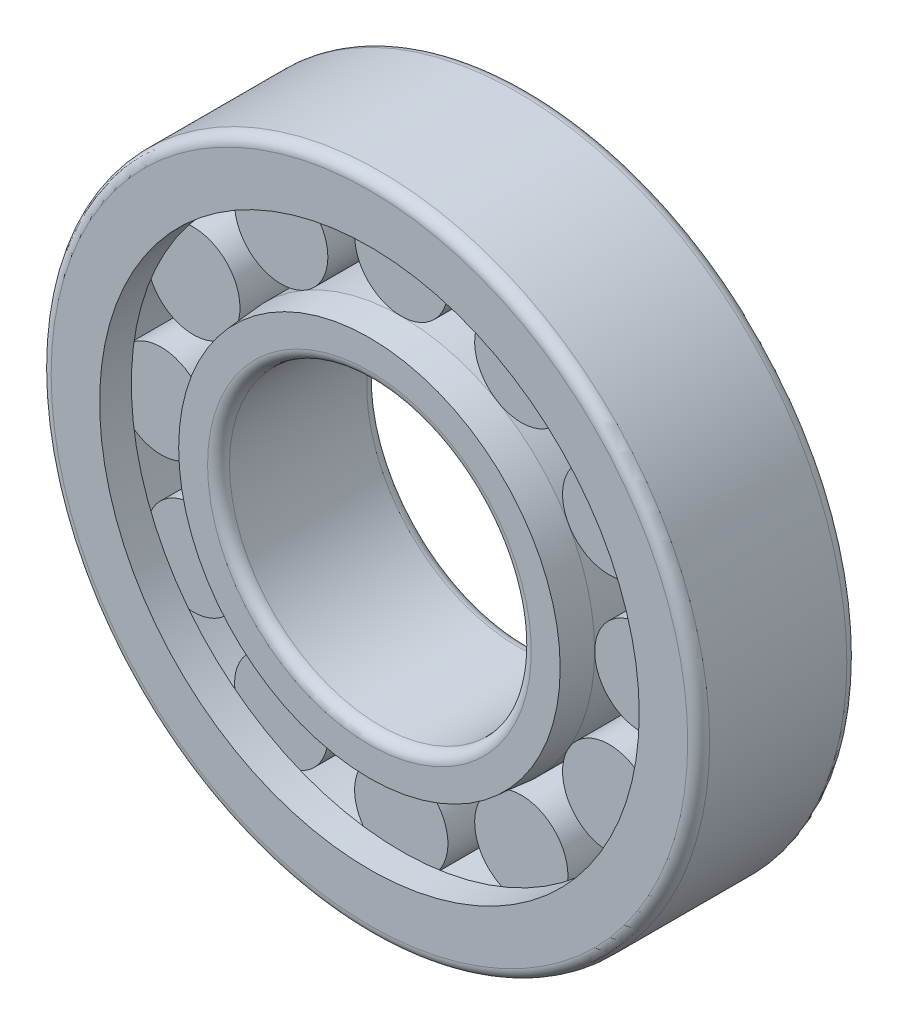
ISO-10303-21;
HEADER;
FILE_DESCRIPTION(('STEP AP214'),'2;1');
FILE_NAME('part.step','',(''),(''),'','','');
FILE_SCHEMA(('AUTOMOTIVE_DESIGN { 1 0 10303 214 1 1 1 1 }'));
ENDSEC;
DATA;
#1=APPLICATION_CONTEXT('core data for automotive mechanical design processes');
#2=APPLICATION_PROTOCOL_DEFINITION('international standard','automotive_design',2000,#1);
#3=PRODUCT_CONTEXT('',#1,'mechanical');
#4=PRODUCT('Part','Part','',(#3));
#5=PRODUCT_RELATED_PRODUCT_CATEGORY('part','',(#4));
#6=PRODUCT_DEFINITION_FORMATION('','',#4);
#7=PRODUCT_DEFINITION_CONTEXT('part definition',#1,'design');
#8=PRODUCT_DEFINITION('design','',#6,#7);
#9=PRODUCT_DEFINITION_SHAPE('','',#8);
#10=(LENGTH_UNIT() NAMED_UNIT(*) SI_UNIT(.MILLI.,.METRE.));
#11=(NAMED_UNIT(*) PLANE_ANGLE_UNIT() SI_UNIT($,.RADIAN.));
#12=(NAMED_UNIT(*) SI_UNIT($,.STERADIAN.) SOLID_ANGLE_UNIT());
#13=UNCERTAINTY_MEASURE_WITH_UNIT(LENGTH_MEASURE(1.E-05),#10,'distance_accuracy_value','');
#14=(GEOMETRIC_REPRESENTATION_CONTEXT(3) GLOBAL_UNCERTAINTY_ASSIGNED_CONTEXT((#13)) GLOBAL_UNIT_ASSIGNED_CONTEXT((#10,
#11,#12)) REPRESENTATION_CONTEXT('',''));
#15=CARTESIAN_POINT('',(0.,0.,0.));
#16=DIRECTION('',(0.,0.,1.));
#17=DIRECTION('',(1.,0.,0.));
#18=AXIS2_PLACEMENT_3D('',#15,#16,#17);
#19=CARTESIAN_POINT('',(0.,27.5,14.5));
#20=DIRECTION('',(0.,0.,-1.));
#21=DIRECTION('',(-1.,0.,0.));
#22=AXIS2_PLACEMENT_3D('',#19,#20,#21);
#23=PLANE('',#22);
#24=CARTESIAN_POINT('',(0.,0.,14.5));
#25=DIRECTION('',(0.,0.,-1.));
#26=DIRECTION('',(-1.,0.,0.));
#27=AXIS2_PLACEMENT_3D('',#24,#25,#26);
#28=CIRCLE('',#27,29.5);
#29=CARTESIAN_POINT('',(-29.5,0.,14.5));
#30=VERTEX_POINT('',#29);
#31=EDGE_CURVE('E632',#30,#30,#28,.T.);
#32=ORIENTED_EDGE('',*,*,#31,.T.);
#33=EDGE_LOOP('',(#32));
#34=FACE_BOUND('',#33,.T.);
#35=CARTESIAN_POINT('',(0.,0.,14.5));
#36=DIRECTION('',(0.,0.,1.));
#37=DIRECTION('',(1.,0.,0.));
#38=AXIS2_PLACEMENT_3D('',#35,#36,#37);
#39=CIRCLE('',#38,34.7647529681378);
#40=CARTESIAN_POINT('',(34.7647529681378,0.,14.5));
#41=VERTEX_POINT('',#40);
#42=EDGE_CURVE('E561',#41,#41,#39,.T.);
#43=ORIENTED_EDGE('',*,*,#42,.T.);
#44=EDGE_LOOP('',(#43));
#45=FACE_BOUND('',#44,.T.);
#46=ADVANCED_FACE('F41',(#34,#45),#23,.F.);
#47=CARTESIAN_POINT('',(0.,27.5,-14.5));
#48=DIRECTION('',(0.,0.,1.));
#49=DIRECTION('',(1.,0.,0.));
#50=AXIS2_PLACEMENT_3D('',#47,#48,#49);
#51=PLANE('',#50);
#52=CARTESIAN_POINT('',(0.,0.,-14.5));
#53=DIRECTION('',(0.,0.,1.));
#54=DIRECTION('',(1.,0.,0.));
#55=AXIS2_PLACEMENT_3D('',#52,#53,#54);
#56=CIRCLE('',#55,29.5);
#57=CARTESIAN_POINT('',(29.5,0.,-14.5));
#58=VERTEX_POINT('',#57);
#59=EDGE_CURVE('E623',#58,#58,#56,.T.);
#60=ORIENTED_EDGE('',*,*,#59,.T.);
#61=EDGE_LOOP('',(#60));
#62=FACE_BOUND('',#61,.T.);
#63=CARTESIAN_POINT('',(0.,0.,-14.5));
#64=DIRECTION('',(0.,0.,1.));
#65=DIRECTION('',(1.,0.,0.));
#66=AXIS2_PLACEMENT_3D('',#63,#64,#65);
#67=CIRCLE('',#66,34.7647529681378);
#68=CARTESIAN_POINT('',(34.7647529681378,0.,-14.5));
#69=VERTEX_POINT('',#68);
#70=EDGE_CURVE('E567',#69,#69,#67,.T.);
#71=ORIENTED_EDGE('',*,*,#70,.F.);
#72=EDGE_LOOP('',(#71));
#73=FACE_BOUND('',#72,.T.);
#74=ADVANCED_FACE('F791',(#62,#73),#51,.F.);
#75=CARTESIAN_POINT('',(0.,35.25,8.69999999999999));
#76=DIRECTION('',(0.,0.,1.));
#77=DIRECTION('',(1.,0.,0.));
#78=AXIS2_PLACEMENT_3D('',#75,#76,#77);
#79=PLANE('',#78);
#80=CARTESIAN_POINT('',(0.,43.75,8.69999999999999));
#81=DIRECTION('',(0.,0.,1.));
#82=DIRECTION('',(1.,0.,0.));
#83=AXIS2_PLACEMENT_3D('',#80,#81,#82);
#84=CIRCLE('',#83,8.49999999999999);
#85=CARTESIAN_POINT('',(-0.636717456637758,52.2261188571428,8.69999999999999));
#86=VERTEX_POINT('',#85);
#87=CARTESIAN_POINT('',(-0.523221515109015,35.2661188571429,8.69999999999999));
#88=VERTEX_POINT('',#87);
#89=EDGE_CURVE('E604',#86,#88,#84,.T.);
#90=ORIENTED_EDGE('',*,*,#89,.T.);
#91=CARTESIAN_POINT('',(0.,0.,8.69999999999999));
#92=DIRECTION('',(0.,0.,1.));
#93=DIRECTION('',(1.,0.,0.));
#94=AXIS2_PLACEMENT_3D('',#91,#92,#93);
#95=CIRCLE('',#94,35.27);
#96=CARTESIAN_POINT('',(0.523221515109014,35.2661188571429,8.69999999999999));
#97=VERTEX_POINT('',#96);
#98=EDGE_CURVE('E576',#88,#97,#95,.F.);
#99=ORIENTED_EDGE('',*,*,#98,.T.);
#100=CARTESIAN_POINT('',(0.636717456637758,52.2261188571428,8.69999999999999));
#101=VERTEX_POINT('',#100);
#102=EDGE_CURVE('E603',#97,#101,#84,.T.);
#103=ORIENTED_EDGE('',*,*,#102,.T.);
#104=CARTESIAN_POINT('',(0.,0.,8.69999999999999));
#105=DIRECTION('',(0.,0.,1.));
#106=DIRECTION('',(1.,0.,0.));
#107=AXIS2_PLACEMENT_3D('',#104,#105,#106);
#108=CIRCLE('',#107,52.23);
#109=EDGE_CURVE('E600',#101,#86,#108,.T.);
#110=ORIENTED_EDGE('',*,*,#109,.T.);
#111=EDGE_LOOP('',(#90,#99,#103,#110));
#112=FACE_BOUND('',#111,.T.);
#113=ADVANCED_FACE('F799',(#112),#79,.T.);
#114=CARTESIAN_POINT('',(0.,35.25,-8.70000000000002));
#115=DIRECTION('',(0.,0.,-1.));
#116=DIRECTION('',(-1.,0.,0.));
#117=AXIS2_PLACEMENT_3D('',#114,#115,#116);
#118=PLANE('',#117);
#119=CARTESIAN_POINT('',(0.,43.75,-8.70000000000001));
#120=DIRECTION('',(0.,0.,1.));
#121=DIRECTION('',(1.,0.,0.));
#122=AXIS2_PLACEMENT_3D('',#119,#120,#121);
#123=CIRCLE('',#122,8.49999999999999);
#124=CARTESIAN_POINT('',(0.523221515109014,35.2661188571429,-8.70000000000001));
#125=VERTEX_POINT('',#124);
#126=CARTESIAN_POINT('',(0.636717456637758,52.2261188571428,-8.70000000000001));
#127=VERTEX_POINT('',#126);
#128=EDGE_CURVE('E607',#125,#127,#123,.T.);
#129=ORIENTED_EDGE('',*,*,#128,.F.);
#130=CARTESIAN_POINT('',(0.,0.,-8.70000000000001));
#131=DIRECTION('',(0.,0.,-1.));
#132=DIRECTION('',(-1.,0.,0.));
#133=AXIS2_PLACEMENT_3D('',#130,#131,#132);
#134=CIRCLE('',#133,35.27);
#135=CARTESIAN_POINT('',(-0.523221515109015,35.2661188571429,-8.70000000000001));
#136=VERTEX_POINT('',#135);
#137=EDGE_CURVE('E573',#125,#136,#134,.F.);
#138=ORIENTED_EDGE('',*,*,#137,.T.);
#139=CARTESIAN_POINT('',(-0.636717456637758,52.2261188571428,-8.70000000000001));
#140=VERTEX_POINT('',#139);
#141=EDGE_CURVE('E608',#140,#136,#123,.T.);
#142=ORIENTED_EDGE('',*,*,#141,.F.);
#143=CARTESIAN_POINT('',(0.,0.,-8.70000000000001));
#144=DIRECTION('',(0.,0.,-1.));
#145=DIRECTION('',(-1.,0.,0.));
#146=AXIS2_PLACEMENT_3D('',#143,#144,#145);
#147=CIRCLE('',#146,52.23);
#148=EDGE_CURVE('E597',#140,#127,#147,.T.);
#149=ORIENTED_EDGE('',*,*,#148,.T.);
#150=EDGE_LOOP('',(#129,#138,#142,#149));
#151=FACE_BOUND('',#150,.T.);
#152=ADVANCED_FACE('F840',(#151),#118,.T.);
#153=CARTESIAN_POINT('',(0.,43.75,8.7));
#154=DIRECTION('',(0.,0.,1.));
#155=DIRECTION('',(1.,0.,0.));
#156=AXIS2_PLACEMENT_3D('',#153,#154,#155);
#157=CYLINDRICAL_SURFACE('',#156,8.49999999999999);
#158=ORIENTED_EDGE('',*,*,#102,.F.);
#159=DIRECTION('',(0.,0.,1.));
#160=VECTOR('',#159,1.);
#161=CARTESIAN_POINT('',(0.523221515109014,35.2661188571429,0.));
#162=LINE('',#161,#160);
#163=EDGE_CURVE('E620',#97,#125,#162,.F.);
#164=ORIENTED_EDGE('',*,*,#163,.T.);
#165=ORIENTED_EDGE('',*,*,#128,.T.);
#166=DIRECTION('',(0.,0.,1.));
#167=VECTOR('',#166,1.);
#168=CARTESIAN_POINT('',(0.636717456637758,52.2261188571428,0.));
#169=LINE('',#168,#167);
#170=EDGE_CURVE('E614',#127,#101,#169,.T.);
#171=ORIENTED_EDGE('',*,*,#170,.T.);
#172=EDGE_LOOP('',(#158,#164,#165,#171));
#173=FACE_BOUND('',#172,.T.);
#174=ADVANCED_FACE('F837',(#173),#157,.T.);
#175=ORIENTED_EDGE('',*,*,#141,.T.);
#176=DIRECTION('',(0.,0.,1.));
#177=VECTOR('',#176,1.);
#178=CARTESIAN_POINT('',(-0.523221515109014,35.2661188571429,0.));
#179=LINE('',#178,#177);
#180=EDGE_CURVE('E617',#136,#88,#179,.T.);
#181=ORIENTED_EDGE('',*,*,#180,.T.);
#182=ORIENTED_EDGE('',*,*,#89,.F.);
#183=DIRECTION('',(0.,0.,1.));
#184=VECTOR('',#183,1.);
#185=CARTESIAN_POINT('',(-0.636717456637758,52.2261188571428,0.));
#186=LINE('',#185,#184);
#187=EDGE_CURVE('E611',#86,#140,#186,.F.);
#188=ORIENTED_EDGE('',*,*,#187,.T.);
#189=EDGE_LOOP('',(#175,#181,#182,#188));
#190=FACE_BOUND('',#189,.T.);
#191=ADVANCED_FACE('F835',(#190),#157,.T.);
#192=CARTESIAN_POINT('',(0.,60.,14.5));
#193=DIRECTION('',(0.,0.,-1.));
#194=DIRECTION('',(-1.,0.,0.));
#195=AXIS2_PLACEMENT_3D('',#192,#193,#194);
#196=PLANE('',#195);
#197=CARTESIAN_POINT('',(0.,0.,14.5));
#198=DIRECTION('',(0.,0.,-1.));
#199=DIRECTION('',(-1.,0.,0.));
#200=AXIS2_PLACEMENT_3D('',#197,#198,#199);
#201=CIRCLE('',#200,58.);
#202=CARTESIAN_POINT('',(-58.,0.,14.5));
#203=VERTEX_POINT('',#202);
#204=EDGE_CURVE('E644',#203,#203,#201,.F.);
#205=ORIENTED_EDGE('',*,*,#204,.T.);
#206=EDGE_LOOP('',(#205));
#207=FACE_BOUND('',#206,.T.);
#208=CARTESIAN_POINT('',(0.,0.,14.5));
#209=DIRECTION('',(0.,0.,1.));
#210=DIRECTION('',(1.,0.,0.));
#211=AXIS2_PLACEMENT_3D('',#208,#209,#210);
#212=CIRCLE('',#211,49.1666666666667);
#213=CARTESIAN_POINT('',(49.1666666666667,0.,14.5));
#214=VERTEX_POINT('',#213);
#215=EDGE_CURVE('E594',#214,#214,#212,.T.);
#216=ORIENTED_EDGE('',*,*,#215,.F.);
#217=EDGE_LOOP('',(#216));
#218=FACE_BOUND('',#217,.T.);
#219=ADVANCED_FACE('F831',(#207,#218),#196,.F.);
#220=CARTESIAN_POINT('',(0.,0.,50.3916163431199));
#221=DIRECTION('',(0.,0.,1.));
#222=DIRECTION('',(1.,0.,0.));
#223=AXIS2_PLACEMENT_3D('',#220,#221,#222);
#224=CYLINDRICAL_SURFACE('',#223,49.1666666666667);
#225=CARTESIAN_POINT('',(0.,0.,8.725));
#226=DIRECTION('',(0.,0.,1.));
#227=DIRECTION('',(1.,0.,0.));
#228=AXIS2_PLACEMENT_3D('',#225,#226,#227);
#229=CIRCLE('',#228,49.1666666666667);
#230=CARTESIAN_POINT('',(49.1666666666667,0.,8.725));
#231=VERTEX_POINT('',#230);
#232=EDGE_CURVE('E591',#231,#231,#229,.T.);
#233=ORIENTED_EDGE('',*,*,#232,.F.);
#234=EDGE_LOOP('',(#233));
#235=FACE_BOUND('',#234,.T.);
#236=ORIENTED_EDGE('',*,*,#215,.T.);
#237=EDGE_LOOP('',(#236));
#238=FACE_BOUND('',#237,.T.);
#239=ADVANCED_FACE('F827',(#235,#238),#224,.F.);
#240=CARTESIAN_POINT('',(0.,49.1666666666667,8.725));
#241=DIRECTION('',(0.,0.,1.));
#242=DIRECTION('',(1.,0.,0.));
#243=AXIS2_PLACEMENT_3D('',#240,#241,#242);
#244=PLANE('',#243);
#245=CARTESIAN_POINT('',(0.,0.,8.725));
#246=DIRECTION('',(0.,0.,1.));
#247=DIRECTION('',(1.,0.,0.));
#248=AXIS2_PLACEMENT_3D('',#245,#246,#247);
#249=CIRCLE('',#248,52.23);
#250=CARTESIAN_POINT('',(52.23,0.,8.725));
#251=VERTEX_POINT('',#250);
#252=EDGE_CURVE('E588',#251,#251,#249,.T.);
#253=ORIENTED_EDGE('',*,*,#252,.F.);
#254=EDGE_LOOP('',(#253));
#255=FACE_BOUND('',#254,.T.);
#256=ORIENTED_EDGE('',*,*,#232,.T.);
#257=EDGE_LOOP('',(#256));
#258=FACE_BOUND('',#257,.T.);
#259=ADVANCED_FACE('F824',(#255,#258),#244,.F.);
#260=CARTESIAN_POINT('',(0.,0.,50.3916163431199));
#261=DIRECTION('',(0.,0.,1.));
#262=DIRECTION('',(1.,0.,0.));
#263=AXIS2_PLACEMENT_3D('',#260,#261,#262);
#264=CYLINDRICAL_SURFACE('',#263,52.23);
#265=CARTESIAN_POINT('',(0.,0.,-8.70000000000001));
#266=DIRECTION('',(0.,0.,-1.));
#267=DIRECTION('',(-1.,0.,0.));
#268=AXIS2_PLACEMENT_3D('',#265,#266,#267);
#269=CIRCLE('',#268,52.23);
#270=CARTESIAN_POINT('',(-25.5616459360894,45.5475043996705,-8.70000000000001));
#271=VERTEX_POINT('',#270);
#272=CARTESIAN_POINT('',(-26.6644729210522,44.9107869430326,-8.70000000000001));
#273=VERTEX_POINT('',#272);
#274=EDGE_CURVE('E355',#271,#273,#269,.F.);
#275=ORIENTED_EDGE('',*,*,#274,.T.);
#276=DIRECTION('',(0.,0.,1.));
#277=VECTOR('',#276,1.);
#278=CARTESIAN_POINT('',(-26.6644729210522,44.9107869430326,0.));
#279=LINE('',#278,#277);
#280=CARTESIAN_POINT('',(-26.6644729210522,44.9107869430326,8.69999999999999));
#281=VERTEX_POINT('',#280);
#282=EDGE_CURVE('E346',#273,#281,#279,.T.);
#283=ORIENTED_EDGE('',*,*,#282,.T.);
#284=CARTESIAN_POINT('',(0.,0.,8.69999999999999));
#285=DIRECTION('',(0.,0.,1.));
#286=DIRECTION('',(1.,0.,0.));
#287=AXIS2_PLACEMENT_3D('',#284,#285,#286);
#288=CIRCLE('',#287,52.23);
#289=CARTESIAN_POINT('',(-25.5616459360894,45.5475043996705,8.69999999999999));
#290=VERTEX_POINT('',#289);
#291=EDGE_CURVE('E366',#281,#290,#288,.F.);
#292=ORIENTED_EDGE('',*,*,#291,.T.);
#293=DIRECTION('',(0.,0.,1.));
#294=VECTOR('',#293,1.);
#295=CARTESIAN_POINT('',(-25.5616459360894,45.5475043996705,0.));
#296=LINE('',#295,#294);
#297=EDGE_CURVE('E356',#290,#271,#296,.F.);
#298=ORIENTED_EDGE('',*,*,#297,.T.);
#299=EDGE_LOOP('',(#275,#283,#292,#298));
#300=FACE_BOUND('',#299,.T.);
#301=CARTESIAN_POINT('',(0.,0.,-8.70000000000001));
#302=DIRECTION('',(0.,0.,-1.));
#303=DIRECTION('',(-1.,0.,0.));
#304=AXIS2_PLACEMENT_3D('',#301,#302,#303);
#305=CIRCLE('',#304,52.23);
#306=CARTESIAN_POINT('',(-44.910786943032,26.6644729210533,-8.70000000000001));
#307=VERTEX_POINT('',#306);
#308=CARTESIAN_POINT('',(-45.5475043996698,25.5616459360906,-8.70000000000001));
#309=VERTEX_POINT('',#308);
#310=EDGE_CURVE('E384',#307,#309,#305,.F.);
#311=ORIENTED_EDGE('',*,*,#310,.T.);
#312=DIRECTION('',(0.,0.,1.));
#313=VECTOR('',#312,1.);
#314=CARTESIAN_POINT('',(-45.5475043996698,25.5616459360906,0.));
#315=LINE('',#314,#313);
#316=CARTESIAN_POINT('',(-45.5475043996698,25.5616459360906,8.69999999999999));
#317=VERTEX_POINT('',#316);
#318=EDGE_CURVE('E381',#309,#317,#315,.T.);
#319=ORIENTED_EDGE('',*,*,#318,.T.);
#320=CARTESIAN_POINT('',(0.,0.,8.69999999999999));
#321=DIRECTION('',(0.,0.,1.));
#322=DIRECTION('',(1.,0.,0.));
#323=AXIS2_PLACEMENT_3D('',#320,#321,#322);
#324=CIRCLE('',#323,52.23);
#325=CARTESIAN_POINT('',(-44.910786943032,26.6644729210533,8.69999999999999));
#326=VERTEX_POINT('',#325);
#327=EDGE_CURVE('E387',#317,#326,#324,.F.);
#328=ORIENTED_EDGE('',*,*,#327,.T.);
#329=DIRECTION('',(0.,0.,1.));
#330=VECTOR('',#329,1.);
#331=CARTESIAN_POINT('',(-44.910786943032,26.6644729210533,0.));
#332=LINE('',#331,#330);
#333=EDGE_CURVE('E378',#326,#307,#332,.F.);
#334=ORIENTED_EDGE('',*,*,#333,.T.);
#335=EDGE_LOOP('',(#311,#319,#328,#334));
#336=FACE_BOUND('',#335,.T.);
#337=CARTESIAN_POINT('',(0.,0.,-8.70000000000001));
#338=DIRECTION('',(0.,0.,-1.));
#339=DIRECTION('',(-1.,0.,0.));
#340=AXIS2_PLACEMENT_3D('',#337,#338,#339);
#341=CIRCLE('',#340,52.23);
#342=CARTESIAN_POINT('',(-52.2261188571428,0.63671745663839,-8.70000000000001));
#343=VERTEX_POINT('',#342);
#344=CARTESIAN_POINT('',(-52.2261188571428,-0.636717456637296,-8.70000000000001));
#345=VERTEX_POINT('',#344);
#346=EDGE_CURVE('E403',#343,#345,#341,.F.);
#347=ORIENTED_EDGE('',*,*,#346,.T.);
#348=DIRECTION('',(0.,0.,1.));
#349=VECTOR('',#348,1.);
#350=CARTESIAN_POINT('',(-52.2261188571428,-0.636717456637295,0.));
#351=LINE('',#350,#349);
#352=CARTESIAN_POINT('',(-52.2261188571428,-0.636717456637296,8.69999999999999));
#353=VERTEX_POINT('',#352);
#354=EDGE_CURVE('E400',#345,#353,#351,.T.);
#355=ORIENTED_EDGE('',*,*,#354,.T.);
#356=CARTESIAN_POINT('',(0.,0.,8.69999999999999));
#357=DIRECTION('',(0.,0.,1.));
#358=DIRECTION('',(1.,0.,0.));
#359=AXIS2_PLACEMENT_3D('',#356,#357,#358);
#360=CIRCLE('',#359,52.23);
#361=CARTESIAN_POINT('',(-52.2261188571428,0.636717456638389,8.69999999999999));
#362=VERTEX_POINT('',#361);
#363=EDGE_CURVE('E406',#353,#362,#360,.F.);
#364=ORIENTED_EDGE('',*,*,#363,.T.);
#365=DIRECTION('',(0.,0.,1.));
#366=VECTOR('',#365,1.);
#367=CARTESIAN_POINT('',(-52.2261188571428,0.63671745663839,0.));
#368=LINE('',#367,#366);
#369=EDGE_CURVE('E397',#362,#343,#368,.F.);
#370=ORIENTED_EDGE('',*,*,#369,.T.);
#371=EDGE_LOOP('',(#347,#355,#364,#370));
#372=FACE_BOUND('',#371,.T.);
#373=CARTESIAN_POINT('',(0.,0.,-8.70000000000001));
#374=DIRECTION('',(0.,0.,-1.));
#375=DIRECTION('',(-1.,0.,0.));
#376=AXIS2_PLACEMENT_3D('',#373,#374,#375);
#377=CIRCLE('',#376,52.23);
#378=CARTESIAN_POINT('',(-45.5475043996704,-25.5616459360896,-8.70000000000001));
#379=VERTEX_POINT('',#378);
#380=CARTESIAN_POINT('',(-44.9107869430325,-26.6644729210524,-8.70000000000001));
#381=VERTEX_POINT('',#380);
#382=EDGE_CURVE('E422',#379,#381,#377,.F.);
#383=ORIENTED_EDGE('',*,*,#382,.T.);
#384=DIRECTION('',(0.,0.,1.));
#385=VECTOR('',#384,1.);
#386=CARTESIAN_POINT('',(-44.9107869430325,-26.6644729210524,0.));
#387=LINE('',#386,#385);
#388=CARTESIAN_POINT('',(-44.9107869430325,-26.6644729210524,8.69999999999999));
#389=VERTEX_POINT('',#388);
#390=EDGE_CURVE('E419',#381,#389,#387,.T.);
#391=ORIENTED_EDGE('',*,*,#390,.T.);
#392=CARTESIAN_POINT('',(0.,0.,8.69999999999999));
#393=DIRECTION('',(0.,0.,1.));
#394=DIRECTION('',(1.,0.,0.));
#395=AXIS2_PLACEMENT_3D('',#392,#393,#394);
#396=CIRCLE('',#395,52.23);
#397=CARTESIAN_POINT('',(-45.5475043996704,-25.5616459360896,8.69999999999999));
#398=VERTEX_POINT('',#397);
#399=EDGE_CURVE('E425',#389,#398,#396,.F.);
#400=ORIENTED_EDGE('',*,*,#399,.T.);
#401=DIRECTION('',(0.,0.,1.));
#402=VECTOR('',#401,1.);
#403=CARTESIAN_POINT('',(-45.5475043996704,-25.5616459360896,0.));
#404=LINE('',#403,#402);
#405=EDGE_CURVE('E416',#398,#379,#404,.F.);
#406=ORIENTED_EDGE('',*,*,#405,.T.);
#407=EDGE_LOOP('',(#383,#391,#400,#406));
#408=FACE_BOUND('',#407,.T.);
#409=CARTESIAN_POINT('',(0.,0.,-8.70000000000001));
#410=DIRECTION('',(0.,0.,-1.));
#411=DIRECTION('',(-1.,0.,0.));
#412=AXIS2_PLACEMENT_3D('',#409,#410,#411);
#413=CIRCLE('',#412,52.23);
#414=CARTESIAN_POINT('',(-26.6644729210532,-44.9107869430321,-8.70000000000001));
#415=VERTEX_POINT('',#414);
#416=CARTESIAN_POINT('',(-25.5616459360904,-45.5475043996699,-8.70000000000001));
#417=VERTEX_POINT('',#416);
#418=EDGE_CURVE('E441',#415,#417,#413,.F.);
#419=ORIENTED_EDGE('',*,*,#418,.T.);
#420=DIRECTION('',(0.,0.,1.));
#421=VECTOR('',#420,1.);
#422=CARTESIAN_POINT('',(-25.5616459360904,-45.5475043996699,0.));
#423=LINE('',#422,#421);
#424=CARTESIAN_POINT('',(-25.5616459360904,-45.5475043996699,8.69999999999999));
#425=VERTEX_POINT('',#424);
#426=EDGE_CURVE('E438',#417,#425,#423,.T.);
#427=ORIENTED_EDGE('',*,*,#426,.T.);
#428=CARTESIAN_POINT('',(0.,0.,8.69999999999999));
#429=DIRECTION('',(0.,0.,1.));
#430=DIRECTION('',(1.,0.,0.));
#431=AXIS2_PLACEMENT_3D('',#428,#429,#430);
#432=CIRCLE('',#431,52.23);
#433=CARTESIAN_POINT('',(-26.6644729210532,-44.9107869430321,8.69999999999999));
#434=VERTEX_POINT('',#433);
#435=EDGE_CURVE('E444',#425,#434,#432,.F.);
#436=ORIENTED_EDGE('',*,*,#435,.T.);
#437=DIRECTION('',(0.,0.,1.));
#438=VECTOR('',#437,1.);
#439=CARTESIAN_POINT('',(-26.6644729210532,-44.9107869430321,0.));
#440=LINE('',#439,#438);
#441=EDGE_CURVE('E435',#434,#415,#440,.F.);
#442=ORIENTED_EDGE('',*,*,#441,.T.);
#443=EDGE_LOOP('',(#419,#427,#436,#442));
#444=FACE_BOUND('',#443,.T.);
#445=CARTESIAN_POINT('',(0.,0.,-8.70000000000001));
#446=DIRECTION('',(0.,0.,-1.));
#447=DIRECTION('',(-1.,0.,0.));
#448=AXIS2_PLACEMENT_3D('',#445,#446,#447);
#449=CIRCLE('',#448,52.23);
#450=CARTESIAN_POINT('',(-0.636717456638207,-52.2261188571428,-8.70000000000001));
#451=VERTEX_POINT('',#450);
#452=CARTESIAN_POINT('',(0.636717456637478,-52.2261188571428,-8.70000000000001));
#453=VERTEX_POINT('',#452);
#454=EDGE_CURVE('E460',#451,#453,#449,.F.);
#455=ORIENTED_EDGE('',*,*,#454,.T.);
#456=DIRECTION('',(0.,0.,1.));
#457=VECTOR('',#456,1.);
#458=CARTESIAN_POINT('',(0.636717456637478,-52.2261188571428,0.));
#459=LINE('',#458,#457);
#460=CARTESIAN_POINT('',(0.636717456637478,-52.2261188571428,8.69999999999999));
#461=VERTEX_POINT('',#460);
#462=EDGE_CURVE('E457',#453,#461,#459,.T.);
#463=ORIENTED_EDGE('',*,*,#462,.T.);
#464=CARTESIAN_POINT('',(0.,0.,8.69999999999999));
#465=DIRECTION('',(0.,0.,1.));
#466=DIRECTION('',(1.,0.,0.));
#467=AXIS2_PLACEMENT_3D('',#464,#465,#466);
#468=CIRCLE('',#467,52.23);
#469=CARTESIAN_POINT('',(-0.636717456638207,-52.2261188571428,8.69999999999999));
#470=VERTEX_POINT('',#469);
#471=EDGE_CURVE('E463',#461,#470,#468,.F.);
#472=ORIENTED_EDGE('',*,*,#471,.T.);
#473=DIRECTION('',(0.,0.,1.));
#474=VECTOR('',#473,1.);
#475=CARTESIAN_POINT('',(-0.636717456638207,-52.2261188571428,0.));
#476=LINE('',#475,#474);
#477=EDGE_CURVE('E454',#470,#451,#476,.F.);
#478=ORIENTED_EDGE('',*,*,#477,.T.);
#479=EDGE_LOOP('',(#455,#463,#472,#478));
#480=FACE_BOUND('',#479,.T.);
#481=CARTESIAN_POINT('',(0.,0.,-8.70000000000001));
#482=DIRECTION('',(0.,0.,-1.));
#483=DIRECTION('',(-1.,0.,0.));
#484=AXIS2_PLACEMENT_3D('',#481,#482,#483);
#485=CIRCLE('',#484,52.23);
#486=CARTESIAN_POINT('',(25.5616459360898,-45.5475043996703,-8.70000000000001));
#487=VERTEX_POINT('',#486);
#488=CARTESIAN_POINT('',(26.6644729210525,-44.9107869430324,-8.70000000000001));
#489=VERTEX_POINT('',#488);
#490=EDGE_CURVE('E479',#487,#489,#485,.F.);
#491=ORIENTED_EDGE('',*,*,#490,.T.);
#492=DIRECTION('',(0.,0.,1.));
#493=VECTOR('',#492,1.);
#494=CARTESIAN_POINT('',(26.6644729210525,-44.9107869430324,0.));
#495=LINE('',#494,#493);
#496=CARTESIAN_POINT('',(26.6644729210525,-44.9107869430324,8.69999999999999));
#497=VERTEX_POINT('',#496);
#498=EDGE_CURVE('E476',#489,#497,#495,.T.);
#499=ORIENTED_EDGE('',*,*,#498,.T.);
#500=CARTESIAN_POINT('',(0.,0.,8.69999999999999));
#501=DIRECTION('',(0.,0.,1.));
#502=DIRECTION('',(1.,0.,0.));
#503=AXIS2_PLACEMENT_3D('',#500,#501,#502);
#504=CIRCLE('',#503,52.23);
#505=CARTESIAN_POINT('',(25.5616459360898,-45.5475043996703,8.69999999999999));
#506=VERTEX_POINT('',#505);
#507=EDGE_CURVE('E482',#497,#506,#504,.F.);
#508=ORIENTED_EDGE('',*,*,#507,.T.);
#509=DIRECTION('',(0.,0.,1.));
#510=VECTOR('',#509,1.);
#511=CARTESIAN_POINT('',(25.5616459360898,-45.5475043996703,0.));
#512=LINE('',#511,#510);
#513=EDGE_CURVE('E473',#506,#487,#512,.F.);
#514=ORIENTED_EDGE('',*,*,#513,.T.);
#515=EDGE_LOOP('',(#491,#499,#508,#514));
#516=FACE_BOUND('',#515,.T.);
#517=CARTESIAN_POINT('',(0.,0.,-8.70000000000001));
#518=DIRECTION('',(0.,0.,-1.));
#519=DIRECTION('',(-1.,0.,0.));
#520=AXIS2_PLACEMENT_3D('',#517,#518,#519);
#521=CIRCLE('',#520,52.23);
#522=CARTESIAN_POINT('',(44.9107869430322,-26.664472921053,-8.70000000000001));
#523=VERTEX_POINT('',#522);
#524=CARTESIAN_POINT('',(45.54750439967,-25.5616459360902,-8.70000000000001));
#525=VERTEX_POINT('',#524);
#526=EDGE_CURVE('E498',#523,#525,#521,.F.);
#527=ORIENTED_EDGE('',*,*,#526,.T.);
#528=DIRECTION('',(0.,0.,1.));
#529=VECTOR('',#528,1.);
#530=CARTESIAN_POINT('',(45.54750439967,-25.5616459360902,0.));
#531=LINE('',#530,#529);
#532=CARTESIAN_POINT('',(45.54750439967,-25.5616459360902,8.69999999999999));
#533=VERTEX_POINT('',#532);
#534=EDGE_CURVE('E495',#525,#533,#531,.T.);
#535=ORIENTED_EDGE('',*,*,#534,.T.);
#536=CARTESIAN_POINT('',(0.,0.,8.69999999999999));
#537=DIRECTION('',(0.,0.,1.));
#538=DIRECTION('',(1.,0.,0.));
#539=AXIS2_PLACEMENT_3D('',#536,#537,#538);
#540=CIRCLE('',#539,52.23);
#541=CARTESIAN_POINT('',(44.9107869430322,-26.664472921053,8.69999999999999));
#542=VERTEX_POINT('',#541);
#543=EDGE_CURVE('E501',#533,#542,#540,.F.);
#544=ORIENTED_EDGE('',*,*,#543,.T.);
#545=DIRECTION('',(0.,0.,1.));
#546=VECTOR('',#545,1.);
#547=CARTESIAN_POINT('',(44.9107869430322,-26.664472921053,0.));
#548=LINE('',#547,#546);
#549=EDGE_CURVE('E492',#542,#523,#548,.F.);
#550=ORIENTED_EDGE('',*,*,#549,.T.);
#551=EDGE_LOOP('',(#527,#535,#544,#550));
#552=FACE_BOUND('',#551,.T.);
#553=CARTESIAN_POINT('',(0.,0.,-8.70000000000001));
#554=DIRECTION('',(0.,0.,-1.));
#555=DIRECTION('',(-1.,0.,0.));
#556=AXIS2_PLACEMENT_3D('',#553,#554,#555);
#557=CIRCLE('',#556,52.23);
#558=CARTESIAN_POINT('',(52.2261188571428,-0.636717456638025,-8.70000000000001));
#559=VERTEX_POINT('',#558);
#560=CARTESIAN_POINT('',(52.2261188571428,0.63671745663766,-8.70000000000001));
#561=VERTEX_POINT('',#560);
#562=EDGE_CURVE('E517',#559,#561,#557,.F.);
#563=ORIENTED_EDGE('',*,*,#562,.T.);
#564=DIRECTION('',(0.,0.,1.));
#565=VECTOR('',#564,1.);
#566=CARTESIAN_POINT('',(52.2261188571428,0.63671745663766,0.));
#567=LINE('',#566,#565);
#568=CARTESIAN_POINT('',(52.2261188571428,0.63671745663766,8.69999999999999));
#569=VERTEX_POINT('',#568);
#570=EDGE_CURVE('E514',#561,#569,#567,.T.);
#571=ORIENTED_EDGE('',*,*,#570,.T.);
#572=CARTESIAN_POINT('',(0.,0.,8.69999999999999));
#573=DIRECTION('',(0.,0.,1.));
#574=DIRECTION('',(1.,0.,0.));
#575=AXIS2_PLACEMENT_3D('',#572,#573,#574);
#576=CIRCLE('',#575,52.23);
#577=CARTESIAN_POINT('',(52.2261188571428,-0.636717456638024,8.69999999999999));
#578=VERTEX_POINT('',#577);
#579=EDGE_CURVE('E520',#569,#578,#576,.F.);
#580=ORIENTED_EDGE('',*,*,#579,.T.);
#581=DIRECTION('',(0.,0.,1.));
#582=VECTOR('',#581,1.);
#583=CARTESIAN_POINT('',(52.2261188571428,-0.636717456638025,0.));
#584=LINE('',#583,#582);
#585=EDGE_CURVE('E511',#578,#559,#584,.F.);
#586=ORIENTED_EDGE('',*,*,#585,.T.);
#587=EDGE_LOOP('',(#563,#571,#580,#586));
#588=FACE_BOUND('',#587,.T.);
#589=CARTESIAN_POINT('',(0.,0.,-8.70000000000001));
#590=DIRECTION('',(0.,0.,-1.));
#591=DIRECTION('',(-1.,0.,0.));
#592=AXIS2_PLACEMENT_3D('',#589,#590,#591);
#593=CIRCLE('',#592,52.23);
#594=CARTESIAN_POINT('',(45.5475043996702,25.5616459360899,-8.70000000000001));
#595=VERTEX_POINT('',#594);
#596=CARTESIAN_POINT('',(44.9107869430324,26.6644729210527,-8.70000000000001));
#597=VERTEX_POINT('',#596);
#598=EDGE_CURVE('E536',#595,#597,#593,.F.);
#599=ORIENTED_EDGE('',*,*,#598,.T.);
#600=DIRECTION('',(0.,0.,1.));
#601=VECTOR('',#600,1.);
#602=CARTESIAN_POINT('',(44.9107869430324,26.6644729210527,0.));
#603=LINE('',#602,#601);
#604=CARTESIAN_POINT('',(44.9107869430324,26.6644729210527,8.69999999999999));
#605=VERTEX_POINT('',#604);
#606=EDGE_CURVE('E533',#597,#605,#603,.T.);
#607=ORIENTED_EDGE('',*,*,#606,.T.);
#608=CARTESIAN_POINT('',(0.,0.,8.69999999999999));
#609=DIRECTION('',(0.,0.,1.));
#610=DIRECTION('',(1.,0.,0.));
#611=AXIS2_PLACEMENT_3D('',#608,#609,#610);
#612=CIRCLE('',#611,52.23);
#613=CARTESIAN_POINT('',(45.5475043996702,25.5616459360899,8.69999999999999));
#614=VERTEX_POINT('',#613);
#615=EDGE_CURVE('E539',#605,#614,#612,.F.);
#616=ORIENTED_EDGE('',*,*,#615,.T.);
#617=DIRECTION('',(0.,0.,1.));
#618=VECTOR('',#617,1.);
#619=CARTESIAN_POINT('',(45.5475043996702,25.5616459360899,0.));
#620=LINE('',#619,#618);
#621=EDGE_CURVE('E530',#614,#595,#620,.F.);
#622=ORIENTED_EDGE('',*,*,#621,.T.);
#623=EDGE_LOOP('',(#599,#607,#616,#622));
#624=FACE_BOUND('',#623,.T.);
#625=CARTESIAN_POINT('',(0.,0.,-8.70000000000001));
#626=DIRECTION('',(0.,0.,-1.));
#627=DIRECTION('',(-1.,0.,0.));
#628=AXIS2_PLACEMENT_3D('',#625,#626,#627);
#629=CIRCLE('',#628,52.23);
#630=CARTESIAN_POINT('',(26.6644729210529,44.9107869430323,-8.70000000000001));
#631=VERTEX_POINT('',#630);
#632=CARTESIAN_POINT('',(25.5616459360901,45.5475043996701,-8.70000000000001));
#633=VERTEX_POINT('',#632);
#634=EDGE_CURVE('E555',#631,#633,#629,.F.);
#635=ORIENTED_EDGE('',*,*,#634,.T.);
#636=DIRECTION('',(0.,0.,1.));
#637=VECTOR('',#636,1.);
#638=CARTESIAN_POINT('',(25.5616459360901,45.5475043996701,0.));
#639=LINE('',#638,#637);
#640=CARTESIAN_POINT('',(25.5616459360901,45.5475043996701,8.69999999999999));
#641=VERTEX_POINT('',#640);
#642=EDGE_CURVE('E552',#633,#641,#639,.T.);
#643=ORIENTED_EDGE('',*,*,#642,.T.);
#644=CARTESIAN_POINT('',(0.,0.,8.69999999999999));
#645=DIRECTION('',(0.,0.,1.));
#646=DIRECTION('',(1.,0.,0.));
#647=AXIS2_PLACEMENT_3D('',#644,#645,#646);
#648=CIRCLE('',#647,52.23);
#649=CARTESIAN_POINT('',(26.6644729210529,44.9107869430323,8.69999999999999));
#650=VERTEX_POINT('',#649);
#651=EDGE_CURVE('E558',#641,#650,#648,.F.);
#652=ORIENTED_EDGE('',*,*,#651,.T.);
#653=DIRECTION('',(0.,0.,1.));
#654=VECTOR('',#653,1.);
#655=CARTESIAN_POINT('',(26.6644729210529,44.9107869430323,0.));
#656=LINE('',#655,#654);
#657=EDGE_CURVE('E549',#650,#631,#656,.F.);
#658=ORIENTED_EDGE('',*,*,#657,.T.);
#659=EDGE_LOOP('',(#635,#643,#652,#658));
#660=FACE_BOUND('',#659,.T.);
#661=ORIENTED_EDGE('',*,*,#170,.F.);
#662=ORIENTED_EDGE('',*,*,#148,.F.);
#663=ORIENTED_EDGE('',*,*,#187,.F.);
#664=ORIENTED_EDGE('',*,*,#109,.F.);
#665=EDGE_LOOP('',(#661,#662,#663,#664));
#666=FACE_BOUND('',#665,.T.);
#667=CARTESIAN_POINT('',(0.,0.,-8.725));
#668=DIRECTION('',(0.,0.,1.));
#669=DIRECTION('',(1.,0.,0.));
#670=AXIS2_PLACEMENT_3D('',#667,#668,#669);
#671=CIRCLE('',#670,52.23);
#672=CARTESIAN_POINT('',(52.23,0.,-8.725));
#673=VERTEX_POINT('',#672);
#674=EDGE_CURVE('E585',#673,#673,#671,.T.);
#675=ORIENTED_EDGE('',*,*,#674,.F.);
#676=EDGE_LOOP('',(#675));
#677=FACE_BOUND('',#676,.T.);
#678=ORIENTED_EDGE('',*,*,#252,.T.);
#679=EDGE_LOOP('',(#678));
#680=FACE_BOUND('',#679,.T.);
#681=ADVANCED_FACE('F364',(#300,#336,#372,#408,#444,#480,#516,#552,#588,#624,#660,#666,#677,
#680),#264,.F.);
#682=CARTESIAN_POINT('',(0.,49.1666666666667,-8.725));
#683=DIRECTION('',(0.,0.,-1.));
#684=DIRECTION('',(-1.,0.,0.));
#685=AXIS2_PLACEMENT_3D('',#682,#683,#684);
#686=PLANE('',#685);
#687=CARTESIAN_POINT('',(0.,0.,-8.725));
#688=DIRECTION('',(0.,0.,1.));
#689=DIRECTION('',(1.,0.,0.));
#690=AXIS2_PLACEMENT_3D('',#687,#688,#689);
#691=CIRCLE('',#690,49.1666666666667);
#692=CARTESIAN_POINT('',(49.1666666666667,0.,-8.725));
#693=VERTEX_POINT('',#692);
#694=EDGE_CURVE('E582',#693,#693,#691,.T.);
#695=ORIENTED_EDGE('',*,*,#694,.F.);
#696=EDGE_LOOP('',(#695));
#697=FACE_BOUND('',#696,.T.);
#698=ORIENTED_EDGE('',*,*,#674,.T.);
#699=EDGE_LOOP('',(#698));
#700=FACE_BOUND('',#699,.T.);
#701=ADVANCED_FACE('F817',(#697,#700),#686,.F.);
#702=CARTESIAN_POINT('',(0.,0.,50.3916163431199));
#703=DIRECTION('',(0.,0.,1.));
#704=DIRECTION('',(1.,0.,0.));
#705=AXIS2_PLACEMENT_3D('',#702,#703,#704);
#706=CYLINDRICAL_SURFACE('',#705,49.1666666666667);
#707=CARTESIAN_POINT('',(0.,0.,-14.5));
#708=DIRECTION('',(0.,0.,1.));
#709=DIRECTION('',(1.,0.,0.));
#710=AXIS2_PLACEMENT_3D('',#707,#708,#709);
#711=CIRCLE('',#710,49.1666666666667);
#712=CARTESIAN_POINT('',(49.1666666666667,0.,-14.5));
#713=VERTEX_POINT('',#712);
#714=EDGE_CURVE('E579',#713,#713,#711,.T.);
#715=ORIENTED_EDGE('',*,*,#714,.F.);
#716=EDGE_LOOP('',(#715));
#717=FACE_BOUND('',#716,.T.);
#718=ORIENTED_EDGE('',*,*,#694,.T.);
#719=EDGE_LOOP('',(#718));
#720=FACE_BOUND('',#719,.T.);
#721=ADVANCED_FACE('F813',(#717,#720),#706,.F.);
#722=CARTESIAN_POINT('',(0.,60.,-14.5));
#723=DIRECTION('',(0.,0.,1.));
#724=DIRECTION('',(1.,0.,0.));
#725=AXIS2_PLACEMENT_3D('',#722,#723,#724);
#726=PLANE('',#725);
#727=CARTESIAN_POINT('',(0.,0.,-14.5));
#728=DIRECTION('',(0.,0.,1.));
#729=DIRECTION('',(1.,0.,0.));
#730=AXIS2_PLACEMENT_3D('',#727,#728,#729);
#731=CIRCLE('',#730,58.);
#732=CARTESIAN_POINT('',(58.,0.,-14.5));
#733=VERTEX_POINT('',#732);
#734=EDGE_CURVE('E641',#733,#733,#731,.F.);
#735=ORIENTED_EDGE('',*,*,#734,.T.);
#736=EDGE_LOOP('',(#735));
#737=FACE_BOUND('',#736,.T.);
#738=ORIENTED_EDGE('',*,*,#714,.T.);
#739=EDGE_LOOP('',(#738));
#740=FACE_BOUND('',#739,.T.);
#741=ADVANCED_FACE('F809',(#737,#740),#726,.F.);
#742=CARTESIAN_POINT('',(0.,0.,50.3916163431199));
#743=DIRECTION('',(0.,0.,1.));
#744=DIRECTION('',(1.,0.,0.));
#745=AXIS2_PLACEMENT_3D('',#742,#743,#744);
#746=CYLINDRICAL_SURFACE('',#745,60.);
#747=CARTESIAN_POINT('',(0.,0.,-12.5));
#748=DIRECTION('',(0.,0.,1.));
#749=DIRECTION('',(1.,0.,0.));
#750=AXIS2_PLACEMENT_3D('',#747,#748,#749);
#751=CIRCLE('',#750,60.);
#752=CARTESIAN_POINT('',(60.,0.,-12.5));
#753=VERTEX_POINT('',#752);
#754=EDGE_CURVE('E638',#753,#753,#751,.T.);
#755=ORIENTED_EDGE('',*,*,#754,.T.);
#756=EDGE_LOOP('',(#755));
#757=FACE_BOUND('',#756,.T.);
#758=CARTESIAN_POINT('',(0.,0.,12.5));
#759=DIRECTION('',(0.,0.,-1.));
#760=DIRECTION('',(-1.,0.,0.));
#761=AXIS2_PLACEMENT_3D('',#758,#759,#760);
#762=CIRCLE('',#761,60.);
#763=CARTESIAN_POINT('',(-60.,0.,12.5));
#764=VERTEX_POINT('',#763);
#765=EDGE_CURVE('E635',#764,#764,#762,.T.);
#766=ORIENTED_EDGE('',*,*,#765,.T.);
#767=EDGE_LOOP('',(#766));
#768=FACE_BOUND('',#767,.T.);
#769=ADVANCED_FACE('F806',(#757,#768),#746,.T.);
#770=CARTESIAN_POINT('',(0.,0.,70.8625909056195));
#771=DIRECTION('',(0.,0.,1.));
#772=DIRECTION('',(1.,0.,0.));
#773=AXIS2_PLACEMENT_3D('',#770,#771,#772);
#774=CYLINDRICAL_SURFACE('',#773,27.5);
#775=CARTESIAN_POINT('',(0.,0.,-12.5));
#776=DIRECTION('',(0.,0.,1.));
#777=DIRECTION('',(1.,0.,0.));
#778=AXIS2_PLACEMENT_3D('',#775,#776,#777);
#779=CIRCLE('',#778,27.5);
#780=CARTESIAN_POINT('',(27.5,0.,-12.5));
#781=VERTEX_POINT('',#780);
#782=EDGE_CURVE('E629',#781,#781,#779,.F.);
#783=ORIENTED_EDGE('',*,*,#782,.T.);
#784=EDGE_LOOP('',(#783));
#785=FACE_BOUND('',#784,.T.);
#786=CARTESIAN_POINT('',(0.,0.,12.5));
#787=DIRECTION('',(0.,0.,-1.));
#788=DIRECTION('',(-1.,0.,0.));
#789=AXIS2_PLACEMENT_3D('',#786,#787,#788);
#790=CIRCLE('',#789,27.5);
#791=CARTESIAN_POINT('',(-27.5,0.,12.5));
#792=VERTEX_POINT('',#791);
#793=EDGE_CURVE('E626',#792,#792,#790,.F.);
#794=ORIENTED_EDGE('',*,*,#793,.T.);
#795=EDGE_LOOP('',(#794));
#796=FACE_BOUND('',#795,.T.);
#797=ADVANCED_FACE('F805',(#785,#796),#774,.F.);
#798=CARTESIAN_POINT('',(0.,0.,70.8625909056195));
#799=DIRECTION('',(0.,0.,1.));
#800=DIRECTION('',(1.,0.,0.));
#801=AXIS2_PLACEMENT_3D('',#798,#799,#800);
#802=CYLINDRICAL_SURFACE('',#801,35.27);
#803=CARTESIAN_POINT('',(0.,0.,8.69999999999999));
#804=DIRECTION('',(0.,0.,1.));
#805=DIRECTION('',(1.,0.,0.));
#806=AXIS2_PLACEMENT_3D('',#803,#804,#805);
#807=CIRCLE('',#806,35.27);
#808=CARTESIAN_POINT('',(-17.1799363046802,30.8029655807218,8.69999999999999));
#809=VERTEX_POINT('',#808);
#810=CARTESIAN_POINT('',(-18.0861825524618,30.279744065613,8.69999999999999));
#811=VERTEX_POINT('',#810);
#812=EDGE_CURVE('E49',#809,#811,#807,.T.);
#813=ORIENTED_EDGE('',*,*,#812,.T.);
#814=DIRECTION('',(0.,0.,1.));
#815=VECTOR('',#814,1.);
#816=CARTESIAN_POINT('',(-18.0861825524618,30.279744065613,0.));
#817=LINE('',#816,#815);
#818=CARTESIAN_POINT('',(-18.0861825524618,30.279744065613,-8.70000000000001));
#819=VERTEX_POINT('',#818);
#820=EDGE_CURVE('E11',#811,#819,#817,.F.);
#821=ORIENTED_EDGE('',*,*,#820,.T.);
#822=CARTESIAN_POINT('',(0.,0.,-8.70000000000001));
#823=DIRECTION('',(0.,0.,-1.));
#824=DIRECTION('',(-1.,0.,0.));
#825=AXIS2_PLACEMENT_3D('',#822,#823,#824);
#826=CIRCLE('',#825,35.27);
#827=CARTESIAN_POINT('',(-17.1799363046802,30.8029655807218,-8.70000000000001));
#828=VERTEX_POINT('',#827);
#829=EDGE_CURVE('E362',#819,#828,#826,.T.);
#830=ORIENTED_EDGE('',*,*,#829,.T.);
#831=DIRECTION('',(0.,0.,1.));
#832=VECTOR('',#831,1.);
#833=CARTESIAN_POINT('',(-17.1799363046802,30.8029655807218,0.));
#834=LINE('',#833,#832);
#835=EDGE_CURVE('E767',#828,#809,#834,.T.);
#836=ORIENTED_EDGE('',*,*,#835,.T.);
#837=EDGE_LOOP('',(#813,#821,#830,#836));
#838=FACE_BOUND('',#837,.T.);
#839=CARTESIAN_POINT('',(0.,0.,8.69999999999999));
#840=DIRECTION('',(0.,0.,1.));
#841=DIRECTION('',(1.,0.,0.));
#842=AXIS2_PLACEMENT_3D('',#839,#840,#841);
#843=CIRCLE('',#842,35.27);
#844=CARTESIAN_POINT('',(-30.2797440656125,18.0861825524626,8.69999999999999));
#845=VERTEX_POINT('',#844);
#846=CARTESIAN_POINT('',(-30.8029655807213,17.179936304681,8.69999999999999));
#847=VERTEX_POINT('',#846);
#848=EDGE_CURVE('E761',#845,#847,#843,.T.);
#849=ORIENTED_EDGE('',*,*,#848,.T.);
#850=DIRECTION('',(0.,0.,1.));
#851=VECTOR('',#850,1.);
#852=CARTESIAN_POINT('',(-30.8029655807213,17.179936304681,0.));
#853=LINE('',#852,#851);
#854=CARTESIAN_POINT('',(-30.8029655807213,17.179936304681,-8.70000000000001));
#855=VERTEX_POINT('',#854);
#856=EDGE_CURVE('E764',#847,#855,#853,.F.);
#857=ORIENTED_EDGE('',*,*,#856,.T.);
#858=CARTESIAN_POINT('',(0.,0.,-8.70000000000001));
#859=DIRECTION('',(0.,0.,-1.));
#860=DIRECTION('',(-1.,0.,0.));
#861=AXIS2_PLACEMENT_3D('',#858,#859,#860);
#862=CIRCLE('',#861,35.27);
#863=CARTESIAN_POINT('',(-30.2797440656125,18.0861825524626,-8.70000000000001));
#864=VERTEX_POINT('',#863);
#865=EDGE_CURVE('E758',#855,#864,#862,.T.);
#866=ORIENTED_EDGE('',*,*,#865,.T.);
#867=DIRECTION('',(0.,0.,1.));
#868=VECTOR('',#867,1.);
#869=CARTESIAN_POINT('',(-30.2797440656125,18.0861825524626,0.));
#870=LINE('',#869,#868);
#871=EDGE_CURVE('E755',#864,#845,#870,.T.);
#872=ORIENTED_EDGE('',*,*,#871,.T.);
#873=EDGE_LOOP('',(#849,#857,#866,#872));
#874=FACE_BOUND('',#873,.T.);
#875=CARTESIAN_POINT('',(0.,0.,8.69999999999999));
#876=DIRECTION('',(0.,0.,1.));
#877=DIRECTION('',(1.,0.,0.));
#878=AXIS2_PLACEMENT_3D('',#875,#876,#877);
#879=CIRCLE('',#878,35.27);
#880=CARTESIAN_POINT('',(-35.2661188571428,0.523221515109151,8.69999999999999));
#881=VERTEX_POINT('',#880);
#882=CARTESIAN_POINT('',(-35.2661188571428,-0.523221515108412,8.69999999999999));
#883=VERTEX_POINT('',#882);
#884=EDGE_CURVE('E749',#881,#883,#879,.T.);
#885=ORIENTED_EDGE('',*,*,#884,.T.);
#886=DIRECTION('',(0.,0.,1.));
#887=VECTOR('',#886,1.);
#888=CARTESIAN_POINT('',(-35.2661188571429,-0.523221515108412,0.));
#889=LINE('',#888,#887);
#890=CARTESIAN_POINT('',(-35.2661188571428,-0.523221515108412,-8.70000000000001));
#891=VERTEX_POINT('',#890);
#892=EDGE_CURVE('E752',#883,#891,#889,.F.);
#893=ORIENTED_EDGE('',*,*,#892,.T.);
#894=CARTESIAN_POINT('',(0.,0.,-8.70000000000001));
#895=DIRECTION('',(0.,0.,-1.));
#896=DIRECTION('',(-1.,0.,0.));
#897=AXIS2_PLACEMENT_3D('',#894,#895,#896);
#898=CIRCLE('',#897,35.27);
#899=CARTESIAN_POINT('',(-35.2661188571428,0.523221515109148,-8.70000000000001));
#900=VERTEX_POINT('',#899);
#901=EDGE_CURVE('E746',#891,#900,#898,.T.);
#902=ORIENTED_EDGE('',*,*,#901,.T.);
#903=DIRECTION('',(0.,0.,1.));
#904=VECTOR('',#903,1.);
#905=CARTESIAN_POINT('',(-35.2661188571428,0.523221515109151,0.));
#906=LINE('',#905,#904);
#907=EDGE_CURVE('E743',#900,#881,#906,.T.);
#908=ORIENTED_EDGE('',*,*,#907,.T.);
#909=EDGE_LOOP('',(#885,#893,#902,#908));
#910=FACE_BOUND('',#909,.T.);
#911=CARTESIAN_POINT('',(0.,0.,8.69999999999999));
#912=DIRECTION('',(0.,0.,1.));
#913=DIRECTION('',(1.,0.,0.));
#914=AXIS2_PLACEMENT_3D('',#911,#912,#913);
#915=CIRCLE('',#914,35.27);
#916=CARTESIAN_POINT('',(-30.8029655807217,-17.1799363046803,8.69999999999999));
#917=VERTEX_POINT('',#916);
#918=CARTESIAN_POINT('',(-30.2797440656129,-18.0861825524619,8.69999999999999));
#919=VERTEX_POINT('',#918);
#920=EDGE_CURVE('E737',#917,#919,#915,.T.);
#921=ORIENTED_EDGE('',*,*,#920,.T.);
#922=DIRECTION('',(0.,0.,1.));
#923=VECTOR('',#922,1.);
#924=CARTESIAN_POINT('',(-30.2797440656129,-18.0861825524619,0.));
#925=LINE('',#924,#923);
#926=CARTESIAN_POINT('',(-30.2797440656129,-18.0861825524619,-8.70000000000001));
#927=VERTEX_POINT('',#926);
#928=EDGE_CURVE('E740',#919,#927,#925,.F.);
#929=ORIENTED_EDGE('',*,*,#928,.T.);
#930=CARTESIAN_POINT('',(0.,0.,-8.70000000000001));
#931=DIRECTION('',(0.,0.,-1.));
#932=DIRECTION('',(-1.,0.,0.));
#933=AXIS2_PLACEMENT_3D('',#930,#931,#932);
#934=CIRCLE('',#933,35.27);
#935=CARTESIAN_POINT('',(-30.8029655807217,-17.1799363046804,-8.70000000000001));
#936=VERTEX_POINT('',#935);
#937=EDGE_CURVE('E734',#927,#936,#934,.T.);
#938=ORIENTED_EDGE('',*,*,#937,.T.);
#939=DIRECTION('',(0.,0.,1.));
#940=VECTOR('',#939,1.);
#941=CARTESIAN_POINT('',(-30.8029655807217,-17.1799363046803,0.));
#942=LINE('',#941,#940);
#943=EDGE_CURVE('E731',#936,#917,#942,.T.);
#944=ORIENTED_EDGE('',*,*,#943,.T.);
#945=EDGE_LOOP('',(#921,#929,#938,#944));
#946=FACE_BOUND('',#945,.T.);
#947=CARTESIAN_POINT('',(0.,0.,8.69999999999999));
#948=DIRECTION('',(0.,0.,1.));
#949=DIRECTION('',(1.,0.,0.));
#950=AXIS2_PLACEMENT_3D('',#947,#948,#949);
#951=CIRCLE('',#950,35.27);
#952=CARTESIAN_POINT('',(-18.0861825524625,-30.2797440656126,8.69999999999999));
#953=VERTEX_POINT('',#952);
#954=CARTESIAN_POINT('',(-17.1799363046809,-30.8029655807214,8.69999999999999));
#955=VERTEX_POINT('',#954);
#956=EDGE_CURVE('E725',#953,#955,#951,.T.);
#957=ORIENTED_EDGE('',*,*,#956,.T.);
#958=DIRECTION('',(0.,0.,1.));
#959=VECTOR('',#958,1.);
#960=CARTESIAN_POINT('',(-17.1799363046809,-30.8029655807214,0.));
#961=LINE('',#960,#959);
#962=CARTESIAN_POINT('',(-17.1799363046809,-30.8029655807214,-8.70000000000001));
#963=VERTEX_POINT('',#962);
#964=EDGE_CURVE('E728',#955,#963,#961,.F.);
#965=ORIENTED_EDGE('',*,*,#964,.T.);
#966=CARTESIAN_POINT('',(0.,0.,-8.70000000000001));
#967=DIRECTION('',(0.,0.,-1.));
#968=DIRECTION('',(-1.,0.,0.));
#969=AXIS2_PLACEMENT_3D('',#966,#967,#968);
#970=CIRCLE('',#969,35.27);
#971=CARTESIAN_POINT('',(-18.0861825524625,-30.2797440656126,-8.70000000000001));
#972=VERTEX_POINT('',#971);
#973=EDGE_CURVE('E722',#963,#972,#970,.T.);
#974=ORIENTED_EDGE('',*,*,#973,.T.);
#975=DIRECTION('',(0.,0.,1.));
#976=VECTOR('',#975,1.);
#977=CARTESIAN_POINT('',(-18.0861825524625,-30.2797440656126,0.));
#978=LINE('',#977,#976);
#979=EDGE_CURVE('E719',#972,#953,#978,.T.);
#980=ORIENTED_EDGE('',*,*,#979,.T.);
#981=EDGE_LOOP('',(#957,#965,#974,#980));
#982=FACE_BOUND('',#981,.T.);
#983=CARTESIAN_POINT('',(0.,0.,8.69999999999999));
#984=DIRECTION('',(0.,0.,1.));
#985=DIRECTION('',(1.,0.,0.));
#986=AXIS2_PLACEMENT_3D('',#983,#984,#985);
#987=CIRCLE('',#986,35.27);
#988=CARTESIAN_POINT('',(-0.523221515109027,-35.2661188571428,8.69999999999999));
#989=VERTEX_POINT('',#988);
#990=CARTESIAN_POINT('',(0.523221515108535,-35.2661188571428,8.69999999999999));
#991=VERTEX_POINT('',#990);
#992=EDGE_CURVE('E713',#989,#991,#987,.T.);
#993=ORIENTED_EDGE('',*,*,#992,.T.);
#994=DIRECTION('',(0.,0.,1.));
#995=VECTOR('',#994,1.);
#996=CARTESIAN_POINT('',(0.523221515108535,-35.2661188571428,0.));
#997=LINE('',#996,#995);
#998=CARTESIAN_POINT('',(0.523221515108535,-35.2661188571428,-8.70000000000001));
#999=VERTEX_POINT('',#998);
#1000=EDGE_CURVE('E716',#991,#999,#997,.F.);
#1001=ORIENTED_EDGE('',*,*,#1000,.T.);
#1002=CARTESIAN_POINT('',(0.,0.,-8.70000000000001));
#1003=DIRECTION('',(0.,0.,-1.));
#1004=DIRECTION('',(-1.,0.,0.));
#1005=AXIS2_PLACEMENT_3D('',#1002,#1003,#1004);
#1006=CIRCLE('',#1005,35.27);
#1007=CARTESIAN_POINT('',(-0.523221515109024,-35.2661188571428,-8.70000000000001));
#1008=VERTEX_POINT('',#1007);
#1009=EDGE_CURVE('E710',#999,#1008,#1006,.T.);
#1010=ORIENTED_EDGE('',*,*,#1009,.T.);
#1011=DIRECTION('',(0.,0.,1.));
#1012=VECTOR('',#1011,1.);
#1013=CARTESIAN_POINT('',(-0.523221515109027,-35.2661188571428,0.));
#1014=LINE('',#1013,#1012);
#1015=EDGE_CURVE('E707',#1008,#989,#1014,.T.);
#1016=ORIENTED_EDGE('',*,*,#1015,.T.);
#1017=EDGE_LOOP('',(#993,#1001,#1010,#1016));
#1018=FACE_BOUND('',#1017,.T.);
#1019=CARTESIAN_POINT('',(0.,0.,8.69999999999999));
#1020=DIRECTION('',(0.,0.,1.));
#1021=DIRECTION('',(1.,0.,0.));
#1022=AXIS2_PLACEMENT_3D('',#1019,#1020,#1021);
#1023=CIRCLE('',#1022,35.27);
#1024=CARTESIAN_POINT('',(17.1799363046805,-30.8029655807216,8.69999999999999));
#1025=VERTEX_POINT('',#1024);
#1026=CARTESIAN_POINT('',(18.086182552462,-30.2797440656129,8.69999999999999));
#1027=VERTEX_POINT('',#1026);
#1028=EDGE_CURVE('E701',#1025,#1027,#1023,.T.);
#1029=ORIENTED_EDGE('',*,*,#1028,.T.);
#1030=DIRECTION('',(0.,0.,1.));
#1031=VECTOR('',#1030,1.);
#1032=CARTESIAN_POINT('',(18.086182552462,-30.2797440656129,0.));
#1033=LINE('',#1032,#1031);
#1034=CARTESIAN_POINT('',(18.086182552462,-30.2797440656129,-8.70000000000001));
#1035=VERTEX_POINT('',#1034);
#1036=EDGE_CURVE('E704',#1027,#1035,#1033,.F.);
#1037=ORIENTED_EDGE('',*,*,#1036,.T.);
#1038=CARTESIAN_POINT('',(0.,0.,-8.70000000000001));
#1039=DIRECTION('',(0.,0.,-1.));
#1040=DIRECTION('',(-1.,0.,0.));
#1041=AXIS2_PLACEMENT_3D('',#1038,#1039,#1040);
#1042=CIRCLE('',#1041,35.27);
#1043=CARTESIAN_POINT('',(17.1799363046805,-30.8029655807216,-8.70000000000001));
#1044=VERTEX_POINT('',#1043);
#1045=EDGE_CURVE('E698',#1035,#1044,#1042,.T.);
#1046=ORIENTED_EDGE('',*,*,#1045,.T.);
#1047=DIRECTION('',(0.,0.,1.));
#1048=VECTOR('',#1047,1.);
#1049=CARTESIAN_POINT('',(17.1799363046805,-30.8029655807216,0.));
#1050=LINE('',#1049,#1048);
#1051=EDGE_CURVE('E695',#1044,#1025,#1050,.T.);
#1052=ORIENTED_EDGE('',*,*,#1051,.T.);
#1053=EDGE_LOOP('',(#1029,#1037,#1046,#1052));
#1054=FACE_BOUND('',#1053,.T.);
#1055=CARTESIAN_POINT('',(0.,0.,8.69999999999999));
#1056=DIRECTION('',(0.,0.,1.));
#1057=DIRECTION('',(1.,0.,0.));
#1058=AXIS2_PLACEMENT_3D('',#1055,#1056,#1057);
#1059=CIRCLE('',#1058,35.27);
#1060=CARTESIAN_POINT('',(30.2797440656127,-18.0861825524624,8.69999999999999));
#1061=VERTEX_POINT('',#1060);
#1062=CARTESIAN_POINT('',(30.8029655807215,-17.1799363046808,8.69999999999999));
#1063=VERTEX_POINT('',#1062);
#1064=EDGE_CURVE('E689',#1061,#1063,#1059,.T.);
#1065=ORIENTED_EDGE('',*,*,#1064,.T.);
#1066=DIRECTION('',(0.,0.,1.));
#1067=VECTOR('',#1066,1.);
#1068=CARTESIAN_POINT('',(30.8029655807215,-17.1799363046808,0.));
#1069=LINE('',#1068,#1067);
#1070=CARTESIAN_POINT('',(30.8029655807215,-17.1799363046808,-8.70000000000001));
#1071=VERTEX_POINT('',#1070);
#1072=EDGE_CURVE('E692',#1063,#1071,#1069,.F.);
#1073=ORIENTED_EDGE('',*,*,#1072,.T.);
#1074=CARTESIAN_POINT('',(0.,0.,-8.70000000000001));
#1075=DIRECTION('',(0.,0.,-1.));
#1076=DIRECTION('',(-1.,0.,0.));
#1077=AXIS2_PLACEMENT_3D('',#1074,#1075,#1076);
#1078=CIRCLE('',#1077,35.27);
#1079=CARTESIAN_POINT('',(30.2797440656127,-18.0861825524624,-8.70000000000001));
#1080=VERTEX_POINT('',#1079);
#1081=EDGE_CURVE('E686',#1071,#1080,#1078,.T.);
#1082=ORIENTED_EDGE('',*,*,#1081,.T.);
#1083=DIRECTION('',(0.,0.,1.));
#1084=VECTOR('',#1083,1.);
#1085=CARTESIAN_POINT('',(30.2797440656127,-18.0861825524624,0.));
#1086=LINE('',#1085,#1084);
#1087=EDGE_CURVE('E683',#1080,#1061,#1086,.T.);
#1088=ORIENTED_EDGE('',*,*,#1087,.T.);
#1089=EDGE_LOOP('',(#1065,#1073,#1082,#1088));
#1090=FACE_BOUND('',#1089,.T.);
#1091=CARTESIAN_POINT('',(0.,0.,8.69999999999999));
#1092=DIRECTION('',(0.,0.,1.));
#1093=DIRECTION('',(1.,0.,0.));
#1094=AXIS2_PLACEMENT_3D('',#1091,#1092,#1093);
#1095=CIRCLE('',#1094,35.27);
#1096=CARTESIAN_POINT('',(35.2661188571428,-0.523221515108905,8.69999999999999));
#1097=VERTEX_POINT('',#1096);
#1098=CARTESIAN_POINT('',(35.2661188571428,0.523221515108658,8.69999999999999));
#1099=VERTEX_POINT('',#1098);
#1100=EDGE_CURVE('E677',#1097,#1099,#1095,.T.);
#1101=ORIENTED_EDGE('',*,*,#1100,.T.);
#1102=DIRECTION('',(0.,0.,1.));
#1103=VECTOR('',#1102,1.);
#1104=CARTESIAN_POINT('',(35.2661188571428,0.523221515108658,0.));
#1105=LINE('',#1104,#1103);
#1106=CARTESIAN_POINT('',(35.2661188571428,0.523221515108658,-8.70000000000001));
#1107=VERTEX_POINT('',#1106);
#1108=EDGE_CURVE('E680',#1099,#1107,#1105,.F.);
#1109=ORIENTED_EDGE('',*,*,#1108,.T.);
#1110=CARTESIAN_POINT('',(0.,0.,-8.70000000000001));
#1111=DIRECTION('',(0.,0.,-1.));
#1112=DIRECTION('',(-1.,0.,0.));
#1113=AXIS2_PLACEMENT_3D('',#1110,#1111,#1112);
#1114=CIRCLE('',#1113,35.27);
#1115=CARTESIAN_POINT('',(35.2661188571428,-0.523221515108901,-8.70000000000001));
#1116=VERTEX_POINT('',#1115);
#1117=EDGE_CURVE('E674',#1107,#1116,#1114,.T.);
#1118=ORIENTED_EDGE('',*,*,#1117,.T.);
#1119=DIRECTION('',(0.,0.,1.));
#1120=VECTOR('',#1119,1.);
#1121=CARTESIAN_POINT('',(35.2661188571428,-0.523221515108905,0.));
#1122=LINE('',#1121,#1120);
#1123=EDGE_CURVE('E671',#1116,#1097,#1122,.T.);
#1124=ORIENTED_EDGE('',*,*,#1123,.T.);
#1125=EDGE_LOOP('',(#1101,#1109,#1118,#1124));
#1126=FACE_BOUND('',#1125,.T.);
#1127=CARTESIAN_POINT('',(0.,0.,8.69999999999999));
#1128=DIRECTION('',(0.,0.,1.));
#1129=DIRECTION('',(1.,0.,0.));
#1130=AXIS2_PLACEMENT_3D('',#1127,#1128,#1129);
#1131=CIRCLE('',#1130,35.27);
#1132=CARTESIAN_POINT('',(30.8029655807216,17.1799363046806,8.69999999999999));
#1133=VERTEX_POINT('',#1132);
#1134=CARTESIAN_POINT('',(30.2797440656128,18.0861825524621,8.69999999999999));
#1135=VERTEX_POINT('',#1134);
#1136=EDGE_CURVE('E665',#1133,#1135,#1131,.T.);
#1137=ORIENTED_EDGE('',*,*,#1136,.T.);
#1138=DIRECTION('',(0.,0.,1.));
#1139=VECTOR('',#1138,1.);
#1140=CARTESIAN_POINT('',(30.2797440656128,18.0861825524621,0.));
#1141=LINE('',#1140,#1139);
#1142=CARTESIAN_POINT('',(30.2797440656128,18.0861825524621,-8.70000000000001));
#1143=VERTEX_POINT('',#1142);
#1144=EDGE_CURVE('E668',#1135,#1143,#1141,.F.);
#1145=ORIENTED_EDGE('',*,*,#1144,.T.);
#1146=CARTESIAN_POINT('',(0.,0.,-8.70000000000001));
#1147=DIRECTION('',(0.,0.,-1.));
#1148=DIRECTION('',(-1.,0.,0.));
#1149=AXIS2_PLACEMENT_3D('',#1146,#1147,#1148);
#1150=CIRCLE('',#1149,35.27);
#1151=CARTESIAN_POINT('',(30.8029655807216,17.1799363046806,-8.70000000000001));
#1152=VERTEX_POINT('',#1151);
#1153=EDGE_CURVE('E662',#1143,#1152,#1150,.T.);
#1154=ORIENTED_EDGE('',*,*,#1153,.T.);
#1155=DIRECTION('',(0.,0.,1.));
#1156=VECTOR('',#1155,1.);
#1157=CARTESIAN_POINT('',(30.8029655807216,17.1799363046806,0.));
#1158=LINE('',#1157,#1156);
#1159=EDGE_CURVE('E659',#1152,#1133,#1158,.T.);
#1160=ORIENTED_EDGE('',*,*,#1159,.T.);
#1161=EDGE_LOOP('',(#1137,#1145,#1154,#1160));
#1162=FACE_BOUND('',#1161,.T.);
#1163=CARTESIAN_POINT('',(0.,0.,8.69999999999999));
#1164=DIRECTION('',(0.,0.,1.));
#1165=DIRECTION('',(1.,0.,0.));
#1166=AXIS2_PLACEMENT_3D('',#1163,#1164,#1165);
#1167=CIRCLE('',#1166,35.27);
#1168=CARTESIAN_POINT('',(18.0861825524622,30.2797440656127,8.69999999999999));
#1169=VERTEX_POINT('',#1168);
#1170=CARTESIAN_POINT('',(17.1799363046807,30.8029655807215,8.69999999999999));
#1171=VERTEX_POINT('',#1170);
#1172=EDGE_CURVE('E653',#1169,#1171,#1167,.T.);
#1173=ORIENTED_EDGE('',*,*,#1172,.T.);
#1174=DIRECTION('',(0.,0.,1.));
#1175=VECTOR('',#1174,1.);
#1176=CARTESIAN_POINT('',(17.1799363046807,30.8029655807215,0.));
#1177=LINE('',#1176,#1175);
#1178=CARTESIAN_POINT('',(17.1799363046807,30.8029655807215,-8.70000000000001));
#1179=VERTEX_POINT('',#1178);
#1180=EDGE_CURVE('E656',#1171,#1179,#1177,.F.);
#1181=ORIENTED_EDGE('',*,*,#1180,.T.);
#1182=CARTESIAN_POINT('',(0.,0.,-8.70000000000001));
#1183=DIRECTION('',(0.,0.,-1.));
#1184=DIRECTION('',(-1.,0.,0.));
#1185=AXIS2_PLACEMENT_3D('',#1182,#1183,#1184);
#1186=CIRCLE('',#1185,35.27);
#1187=CARTESIAN_POINT('',(18.0861825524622,30.2797440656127,-8.70000000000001));
#1188=VERTEX_POINT('',#1187);
#1189=EDGE_CURVE('E650',#1179,#1188,#1186,.T.);
#1190=ORIENTED_EDGE('',*,*,#1189,.T.);
#1191=DIRECTION('',(0.,0.,1.));
#1192=VECTOR('',#1191,1.);
#1193=CARTESIAN_POINT('',(18.0861825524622,30.2797440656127,0.));
#1194=LINE('',#1193,#1192);
#1195=EDGE_CURVE('E647',#1188,#1169,#1194,.T.);
#1196=ORIENTED_EDGE('',*,*,#1195,.T.);
#1197=EDGE_LOOP('',(#1173,#1181,#1190,#1196));
#1198=FACE_BOUND('',#1197,.T.);
#1199=ORIENTED_EDGE('',*,*,#163,.F.);
#1200=ORIENTED_EDGE('',*,*,#98,.F.);
#1201=ORIENTED_EDGE('',*,*,#180,.F.);
#1202=ORIENTED_EDGE('',*,*,#137,.F.);
#1203=EDGE_LOOP('',(#1199,#1200,#1201,#1202));
#1204=FACE_BOUND('',#1203,.T.);
#1205=CARTESIAN_POINT('',(0.,0.,8.725));
#1206=DIRECTION('',(0.,0.,1.));
#1207=DIRECTION('',(1.,0.,0.));
#1208=AXIS2_PLACEMENT_3D('',#1205,#1206,#1207);
#1209=CIRCLE('',#1208,35.27);
#1210=CARTESIAN_POINT('',(35.27,0.,8.725));
#1211=VERTEX_POINT('',#1210);
#1212=EDGE_CURVE('E564',#1211,#1211,#1209,.T.);
#1213=ORIENTED_EDGE('',*,*,#1212,.F.);
#1214=EDGE_LOOP('',(#1213));
#1215=FACE_BOUND('',#1214,.T.);
#1216=CARTESIAN_POINT('',(0.,0.,-8.725));
#1217=DIRECTION('',(0.,0.,1.));
#1218=DIRECTION('',(1.,0.,0.));
#1219=AXIS2_PLACEMENT_3D('',#1216,#1217,#1218);
#1220=CIRCLE('',#1219,35.27);
#1221=CARTESIAN_POINT('',(35.27,0.,-8.725));
#1222=VERTEX_POINT('',#1221);
#1223=EDGE_CURVE('E570',#1222,#1222,#1220,.T.);
#1224=ORIENTED_EDGE('',*,*,#1223,.T.);
#1225=EDGE_LOOP('',(#1224));
#1226=FACE_BOUND('',#1225,.T.);
#1227=ADVANCED_FACE('F772',(#838,#874,#910,#946,#982,#1018,#1054,#1090,#1126,#1162,#1198,#1204,
#1215,#1226),#802,.T.);
#1228=CARTESIAN_POINT('',(0.,0.,-12.5));
#1229=DIRECTION('',(0.,0.,1.));
#1230=DIRECTION('',(1.,0.,0.));
#1231=AXIS2_PLACEMENT_3D('',#1228,#1229,#1230);
#1232=TOROIDAL_SURFACE('',#1231,29.5,2.);
#1233=ORIENTED_EDGE('',*,*,#782,.F.);
#1234=EDGE_LOOP('',(#1233));
#1235=FACE_BOUND('',#1234,.T.);
#1236=ORIENTED_EDGE('',*,*,#59,.F.);
#1237=EDGE_LOOP('',(#1236));
#1238=FACE_BOUND('',#1237,.T.);
#1239=ADVANCED_FACE('F848',(#1235,#1238),#1232,.T.);
#1240=CARTESIAN_POINT('',(0.,0.,12.5));
#1241=DIRECTION('',(0.,0.,-1.));
#1242=DIRECTION('',(-1.,0.,0.));
#1243=AXIS2_PLACEMENT_3D('',#1240,#1241,#1242);
#1244=TOROIDAL_SURFACE('',#1243,29.5,2.);
#1245=ORIENTED_EDGE('',*,*,#31,.F.);
#1246=EDGE_LOOP('',(#1245));
#1247=FACE_BOUND('',#1246,.T.);
#1248=ORIENTED_EDGE('',*,*,#793,.F.);
#1249=EDGE_LOOP('',(#1248));
#1250=FACE_BOUND('',#1249,.T.);
#1251=ADVANCED_FACE('F851',(#1247,#1250),#1244,.T.);
#1252=CARTESIAN_POINT('',(0.,0.,-12.5));
#1253=DIRECTION('',(0.,0.,1.));
#1254=DIRECTION('',(1.,0.,0.));
#1255=AXIS2_PLACEMENT_3D('',#1252,#1253,#1254);
#1256=TOROIDAL_SURFACE('',#1255,58.,2.);
#1257=ORIENTED_EDGE('',*,*,#734,.F.);
#1258=EDGE_LOOP('',(#1257));
#1259=FACE_BOUND('',#1258,.T.);
#1260=ORIENTED_EDGE('',*,*,#754,.F.);
#1261=EDGE_LOOP('',(#1260));
#1262=FACE_BOUND('',#1261,.T.);
#1263=ADVANCED_FACE('F854',(#1259,#1262),#1256,.T.);
#1264=CARTESIAN_POINT('',(0.,0.,12.5));
#1265=DIRECTION('',(0.,0.,-1.));
#1266=DIRECTION('',(-1.,0.,0.));
#1267=AXIS2_PLACEMENT_3D('',#1264,#1265,#1266);
#1268=TOROIDAL_SURFACE('',#1267,58.,2.);
#1269=ORIENTED_EDGE('',*,*,#765,.F.);
#1270=EDGE_LOOP('',(#1269));
#1271=FACE_BOUND('',#1270,.T.);
#1272=ORIENTED_EDGE('',*,*,#204,.F.);
#1273=EDGE_LOOP('',(#1272));
#1274=FACE_BOUND('',#1273,.T.);
#1275=ADVANCED_FACE('F43',(#1271,#1274),#1268,.T.);
#1276=CARTESIAN_POINT('',(0.,0.,-8.725));
#1277=DIRECTION('',(0.,0.,1.));
#1278=DIRECTION('',(1.,0.,0.));
#1279=AXIS2_PLACEMENT_3D('',#1276,#1277,#1278);
#1280=CONICAL_SURFACE('',#1279,35.27,0.08726646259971);
#1281=ORIENTED_EDGE('',*,*,#70,.T.);
#1282=EDGE_LOOP('',(#1281));
#1283=FACE_BOUND('',#1282,.T.);
#1284=ORIENTED_EDGE('',*,*,#1223,.F.);
#1285=EDGE_LOOP('',(#1284));
#1286=FACE_BOUND('',#1285,.T.);
#1287=ADVANCED_FACE('F861',(#1283,#1286),#1280,.T.);
#1288=CARTESIAN_POINT('',(0.,0.,8.725));
#1289=DIRECTION('',(0.,0.,-1.));
#1290=DIRECTION('',(1.,0.,0.));
#1291=AXIS2_PLACEMENT_3D('',#1288,#1289,#1290);
#1292=CONICAL_SURFACE('',#1291,35.27,0.08726646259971);
#1293=ORIENTED_EDGE('',*,*,#42,.F.);
#1294=EDGE_LOOP('',(#1293));
#1295=FACE_BOUND('',#1294,.T.);
#1296=ORIENTED_EDGE('',*,*,#1212,.T.);
#1297=EDGE_LOOP('',(#1296));
#1298=FACE_BOUND('',#1297,.T.);
#1299=ADVANCED_FACE('F886',(#1295,#1298),#1292,.T.);
#1300=CARTESIAN_POINT('',(17.625,30.5273954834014,8.69999999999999));
#1301=DIRECTION('',(0.,0.,1.));
#1302=DIRECTION('',(0.866025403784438,-0.500000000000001,0.));
#1303=AXIS2_PLACEMENT_3D('',#1300,#1301,#1302);
#1304=PLANE('',#1303);
#1305=ORIENTED_EDGE('',*,*,#651,.F.);
#1306=CARTESIAN_POINT('',(21.875,37.8886114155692,8.69999999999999));
#1307=DIRECTION('',(0.,0.,1.));
#1308=DIRECTION('',(0.866025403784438,-0.500000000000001,0.));
#1309=AXIS2_PLACEMENT_3D('',#1306,#1307,#1308);
#1310=CIRCLE('',#1309,8.49999999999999);
#1311=EDGE_CURVE('E545',#641,#1171,#1310,.T.);
#1312=ORIENTED_EDGE('',*,*,#1311,.T.);
#1313=ORIENTED_EDGE('',*,*,#1172,.F.);
#1314=EDGE_CURVE('E542',#1169,#650,#1310,.T.);
#1315=ORIENTED_EDGE('',*,*,#1314,.T.);
#1316=EDGE_LOOP('',(#1305,#1312,#1313,#1315));
#1317=FACE_BOUND('',#1316,.T.);
#1318=ADVANCED_FACE('F891',(#1317),#1304,.T.);
#1319=CARTESIAN_POINT('',(17.625,30.5273954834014,-8.70000000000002));
#1320=DIRECTION('',(0.,0.,-1.));
#1321=DIRECTION('',(-0.866025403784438,0.500000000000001,0.));
#1322=AXIS2_PLACEMENT_3D('',#1319,#1320,#1321);
#1323=PLANE('',#1322);
#1324=ORIENTED_EDGE('',*,*,#634,.F.);
#1325=CARTESIAN_POINT('',(21.875,37.8886114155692,-8.70000000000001));
#1326=DIRECTION('',(0.,0.,1.));
#1327=DIRECTION('',(0.866025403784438,-0.500000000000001,0.));
#1328=AXIS2_PLACEMENT_3D('',#1325,#1326,#1327);
#1329=CIRCLE('',#1328,8.49999999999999);
#1330=EDGE_CURVE('E546',#1188,#631,#1329,.T.);
#1331=ORIENTED_EDGE('',*,*,#1330,.F.);
#1332=ORIENTED_EDGE('',*,*,#1189,.F.);
#1333=EDGE_CURVE('E548',#633,#1179,#1329,.T.);
#1334=ORIENTED_EDGE('',*,*,#1333,.F.);
#1335=EDGE_LOOP('',(#1324,#1331,#1332,#1334));
#1336=FACE_BOUND('',#1335,.T.);
#1337=ADVANCED_FACE('F963',(#1336),#1323,.T.);
#1338=CARTESIAN_POINT('',(21.875,37.8886114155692,8.7));
#1339=DIRECTION('',(0.,0.,1.));
#1340=DIRECTION('',(0.866025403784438,-0.500000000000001,0.));
#1341=AXIS2_PLACEMENT_3D('',#1338,#1339,#1340);
#1342=CYLINDRICAL_SURFACE('',#1341,8.49999999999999);
#1343=ORIENTED_EDGE('',*,*,#642,.F.);
#1344=ORIENTED_EDGE('',*,*,#1333,.T.);
#1345=ORIENTED_EDGE('',*,*,#1180,.F.);
#1346=ORIENTED_EDGE('',*,*,#1311,.F.);
#1347=EDGE_LOOP('',(#1343,#1344,#1345,#1346));
#1348=FACE_BOUND('',#1347,.T.);
#1349=ADVANCED_FACE('F973',(#1348),#1342,.T.);
#1350=ORIENTED_EDGE('',*,*,#657,.F.);
#1351=ORIENTED_EDGE('',*,*,#1314,.F.);
#1352=ORIENTED_EDGE('',*,*,#1195,.F.);
#1353=ORIENTED_EDGE('',*,*,#1330,.T.);
#1354=EDGE_LOOP('',(#1350,#1351,#1352,#1353));
#1355=FACE_BOUND('',#1354,.T.);
#1356=ADVANCED_FACE('F984',(#1355),#1342,.T.);
#1357=CARTESIAN_POINT('',(30.5273954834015,17.6249999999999,8.69999999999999));
#1358=DIRECTION('',(0.,0.,1.));
#1359=DIRECTION('',(0.499999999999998,-0.86602540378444,0.));
#1360=AXIS2_PLACEMENT_3D('',#1357,#1358,#1359);
#1361=PLANE('',#1360);
#1362=ORIENTED_EDGE('',*,*,#615,.F.);
#1363=CARTESIAN_POINT('',(37.8886114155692,21.8749999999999,8.69999999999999));
#1364=DIRECTION('',(0.,0.,1.));
#1365=DIRECTION('',(0.499999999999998,-0.86602540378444,0.));
#1366=AXIS2_PLACEMENT_3D('',#1363,#1364,#1365);
#1367=CIRCLE('',#1366,8.49999999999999);
#1368=EDGE_CURVE('E526',#605,#1135,#1367,.T.);
#1369=ORIENTED_EDGE('',*,*,#1368,.T.);
#1370=ORIENTED_EDGE('',*,*,#1136,.F.);
#1371=EDGE_CURVE('E523',#1133,#614,#1367,.T.);
#1372=ORIENTED_EDGE('',*,*,#1371,.T.);
#1373=EDGE_LOOP('',(#1362,#1369,#1370,#1372));
#1374=FACE_BOUND('',#1373,.T.);
#1375=ADVANCED_FACE('F995',(#1374),#1361,.T.);
#1376=CARTESIAN_POINT('',(30.5273954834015,17.6249999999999,-8.70000000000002));
#1377=DIRECTION('',(0.,0.,-1.));
#1378=DIRECTION('',(-0.499999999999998,0.86602540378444,0.));
#1379=AXIS2_PLACEMENT_3D('',#1376,#1377,#1378);
#1380=PLANE('',#1379);
#1381=ORIENTED_EDGE('',*,*,#598,.F.);
#1382=CARTESIAN_POINT('',(37.8886114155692,21.8749999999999,-8.70000000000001));
#1383=DIRECTION('',(0.,0.,1.));
#1384=DIRECTION('',(0.499999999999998,-0.86602540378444,0.));
#1385=AXIS2_PLACEMENT_3D('',#1382,#1383,#1384);
#1386=CIRCLE('',#1385,8.49999999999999);
#1387=EDGE_CURVE('E527',#1152,#595,#1386,.T.);
#1388=ORIENTED_EDGE('',*,*,#1387,.F.);
#1389=ORIENTED_EDGE('',*,*,#1153,.F.);
#1390=EDGE_CURVE('E529',#597,#1143,#1386,.T.);
#1391=ORIENTED_EDGE('',*,*,#1390,.F.);
#1392=EDGE_LOOP('',(#1381,#1388,#1389,#1391));
#1393=FACE_BOUND('',#1392,.T.);
#1394=ADVANCED_FACE('F1005',(#1393),#1380,.T.);
#1395=CARTESIAN_POINT('',(37.8886114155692,21.8749999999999,8.7));
#1396=DIRECTION('',(0.,0.,1.));
#1397=DIRECTION('',(0.499999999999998,-0.86602540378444,0.));
#1398=AXIS2_PLACEMENT_3D('',#1395,#1396,#1397);
#1399=CYLINDRICAL_SURFACE('',#1398,8.49999999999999);
#1400=ORIENTED_EDGE('',*,*,#606,.F.);
#1401=ORIENTED_EDGE('',*,*,#1390,.T.);
#1402=ORIENTED_EDGE('',*,*,#1144,.F.);
#1403=ORIENTED_EDGE('',*,*,#1368,.F.);
#1404=EDGE_LOOP('',(#1400,#1401,#1402,#1403));
#1405=FACE_BOUND('',#1404,.T.);
#1406=ADVANCED_FACE('F1016',(#1405),#1399,.T.);
#1407=ORIENTED_EDGE('',*,*,#621,.F.);
#1408=ORIENTED_EDGE('',*,*,#1371,.F.);
#1409=ORIENTED_EDGE('',*,*,#1159,.F.);
#1410=ORIENTED_EDGE('',*,*,#1387,.T.);
#1411=EDGE_LOOP('',(#1407,#1408,#1409,#1410));
#1412=FACE_BOUND('',#1411,.T.);
#1413=ADVANCED_FACE('F1027',(#1412),#1399,.T.);
#1414=CARTESIAN_POINT('',(35.25,-1.2307471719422E-13,8.69999999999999));
#1415=DIRECTION('',(0.,0.,1.));
#1416=DIRECTION('',(0.,-1.,0.));
#1417=AXIS2_PLACEMENT_3D('',#1414,#1415,#1416);
#1418=PLANE('',#1417);
#1419=ORIENTED_EDGE('',*,*,#579,.F.);
#1420=CARTESIAN_POINT('',(43.75,-1.52752308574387E-13,8.69999999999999));
#1421=DIRECTION('',(0.,0.,1.));
#1422=DIRECTION('',(0.,-1.,0.));
#1423=AXIS2_PLACEMENT_3D('',#1420,#1421,#1422);
#1424=CIRCLE('',#1423,8.49999999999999);
#1425=EDGE_CURVE('E507',#569,#1099,#1424,.T.);
#1426=ORIENTED_EDGE('',*,*,#1425,.T.);
#1427=ORIENTED_EDGE('',*,*,#1100,.F.);
#1428=EDGE_CURVE('E504',#1097,#578,#1424,.T.);
#1429=ORIENTED_EDGE('',*,*,#1428,.T.);
#1430=EDGE_LOOP('',(#1419,#1426,#1427,#1429));
#1431=FACE_BOUND('',#1430,.T.);
#1432=ADVANCED_FACE('F1038',(#1431),#1418,.T.);
#1433=CARTESIAN_POINT('',(35.25,-1.2307471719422E-13,-8.70000000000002));
#1434=DIRECTION('',(0.,0.,-1.));
#1435=DIRECTION('',(0.,1.,0.));
#1436=AXIS2_PLACEMENT_3D('',#1433,#1434,#1435);
#1437=PLANE('',#1436);
#1438=ORIENTED_EDGE('',*,*,#562,.F.);
#1439=CARTESIAN_POINT('',(43.75,-1.52752308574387E-13,-8.70000000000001));
#1440=DIRECTION('',(0.,0.,1.));
#1441=DIRECTION('',(0.,-1.,0.));
#1442=AXIS2_PLACEMENT_3D('',#1439,#1440,#1441);
#1443=CIRCLE('',#1442,8.49999999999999);
#1444=EDGE_CURVE('E508',#1116,#559,#1443,.T.);
#1445=ORIENTED_EDGE('',*,*,#1444,.F.);
#1446=ORIENTED_EDGE('',*,*,#1117,.F.);
#1447=EDGE_CURVE('E510',#561,#1107,#1443,.T.);
#1448=ORIENTED_EDGE('',*,*,#1447,.F.);
#1449=EDGE_LOOP('',(#1438,#1445,#1446,#1448));
#1450=FACE_BOUND('',#1449,.T.);
#1451=ADVANCED_FACE('F1048',(#1450),#1437,.T.);
#1452=CARTESIAN_POINT('',(43.75,-1.52752308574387E-13,8.7));
#1453=DIRECTION('',(0.,0.,1.));
#1454=DIRECTION('',(0.,-1.,0.));
#1455=AXIS2_PLACEMENT_3D('',#1452,#1453,#1454);
#1456=CYLINDRICAL_SURFACE('',#1455,8.49999999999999);
#1457=ORIENTED_EDGE('',*,*,#570,.F.);
#1458=ORIENTED_EDGE('',*,*,#1447,.T.);
#1459=ORIENTED_EDGE('',*,*,#1108,.F.);
#1460=ORIENTED_EDGE('',*,*,#1425,.F.);
#1461=EDGE_LOOP('',(#1457,#1458,#1459,#1460));
#1462=FACE_BOUND('',#1461,.T.);
#1463=ADVANCED_FACE('F1059',(#1462),#1456,.T.);
#1464=ORIENTED_EDGE('',*,*,#585,.F.);
#1465=ORIENTED_EDGE('',*,*,#1428,.F.);
#1466=ORIENTED_EDGE('',*,*,#1123,.F.);
#1467=ORIENTED_EDGE('',*,*,#1444,.T.);
#1468=EDGE_LOOP('',(#1464,#1465,#1466,#1467));
#1469=FACE_BOUND('',#1468,.T.);
#1470=ADVANCED_FACE('F1070',(#1469),#1456,.T.);
#1471=CARTESIAN_POINT('',(30.5273954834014,-17.6250000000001,8.69999999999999));
#1472=DIRECTION('',(0.,0.,1.));
#1473=DIRECTION('',(-0.500000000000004,-0.866025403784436,0.));
#1474=AXIS2_PLACEMENT_3D('',#1471,#1472,#1473);
#1475=PLANE('',#1474);
#1476=ORIENTED_EDGE('',*,*,#543,.F.);
#1477=CARTESIAN_POINT('',(37.8886114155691,-21.8750000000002,8.69999999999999));
#1478=DIRECTION('',(0.,0.,1.));
#1479=DIRECTION('',(-0.500000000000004,-0.866025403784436,0.));
#1480=AXIS2_PLACEMENT_3D('',#1477,#1478,#1479);
#1481=CIRCLE('',#1480,8.49999999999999);
#1482=EDGE_CURVE('E488',#533,#1063,#1481,.T.);
#1483=ORIENTED_EDGE('',*,*,#1482,.T.);
#1484=ORIENTED_EDGE('',*,*,#1064,.F.);
#1485=EDGE_CURVE('E485',#1061,#542,#1481,.T.);
#1486=ORIENTED_EDGE('',*,*,#1485,.T.);
#1487=EDGE_LOOP('',(#1476,#1483,#1484,#1486));
#1488=FACE_BOUND('',#1487,.T.);
#1489=ADVANCED_FACE('F1081',(#1488),#1475,.T.);
#1490=CARTESIAN_POINT('',(30.5273954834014,-17.6250000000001,-8.70000000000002));
#1491=DIRECTION('',(0.,0.,-1.));
#1492=DIRECTION('',(0.500000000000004,0.866025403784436,0.));
#1493=AXIS2_PLACEMENT_3D('',#1490,#1491,#1492);
#1494=PLANE('',#1493);
#1495=ORIENTED_EDGE('',*,*,#526,.F.);
#1496=CARTESIAN_POINT('',(37.8886114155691,-21.8750000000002,-8.70000000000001));
#1497=DIRECTION('',(0.,0.,1.));
#1498=DIRECTION('',(-0.500000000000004,-0.866025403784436,0.));
#1499=AXIS2_PLACEMENT_3D('',#1496,#1497,#1498);
#1500=CIRCLE('',#1499,8.49999999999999);
#1501=EDGE_CURVE('E489',#1080,#523,#1500,.T.);
#1502=ORIENTED_EDGE('',*,*,#1501,.F.);
#1503=ORIENTED_EDGE('',*,*,#1081,.F.);
#1504=EDGE_CURVE('E491',#525,#1071,#1500,.T.);
#1505=ORIENTED_EDGE('',*,*,#1504,.F.);
#1506=EDGE_LOOP('',(#1495,#1502,#1503,#1505));
#1507=FACE_BOUND('',#1506,.T.);
#1508=ADVANCED_FACE('F1091',(#1507),#1494,.T.);
#1509=CARTESIAN_POINT('',(37.8886114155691,-21.8750000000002,8.7));
#1510=DIRECTION('',(0.,0.,1.));
#1511=DIRECTION('',(-0.500000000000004,-0.866025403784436,0.));
#1512=AXIS2_PLACEMENT_3D('',#1509,#1510,#1511);
#1513=CYLINDRICAL_SURFACE('',#1512,8.49999999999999);
#1514=ORIENTED_EDGE('',*,*,#534,.F.);
#1515=ORIENTED_EDGE('',*,*,#1504,.T.);
#1516=ORIENTED_EDGE('',*,*,#1072,.F.);
#1517=ORIENTED_EDGE('',*,*,#1482,.F.);
#1518=EDGE_LOOP('',(#1514,#1515,#1516,#1517));
#1519=FACE_BOUND('',#1518,.T.);
#1520=ADVANCED_FACE('F1102',(#1519),#1513,.T.);
#1521=ORIENTED_EDGE('',*,*,#549,.F.);
#1522=ORIENTED_EDGE('',*,*,#1485,.F.);
#1523=ORIENTED_EDGE('',*,*,#1087,.F.);
#1524=ORIENTED_EDGE('',*,*,#1501,.T.);
#1525=EDGE_LOOP('',(#1521,#1522,#1523,#1524));
#1526=FACE_BOUND('',#1525,.T.);
#1527=ADVANCED_FACE('F1113',(#1526),#1513,.T.);
#1528=CARTESIAN_POINT('',(17.6249999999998,-30.5273954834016,8.69999999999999));
#1529=DIRECTION('',(0.,0.,1.));
#1530=DIRECTION('',(-0.866025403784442,-0.499999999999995,0.));
#1531=AXIS2_PLACEMENT_3D('',#1528,#1529,#1530);
#1532=PLANE('',#1531);
#1533=ORIENTED_EDGE('',*,*,#507,.F.);
#1534=CARTESIAN_POINT('',(21.8749999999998,-37.8886114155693,8.69999999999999));
#1535=DIRECTION('',(0.,0.,1.));
#1536=DIRECTION('',(-0.866025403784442,-0.499999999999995,0.));
#1537=AXIS2_PLACEMENT_3D('',#1534,#1535,#1536);
#1538=CIRCLE('',#1537,8.49999999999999);
#1539=EDGE_CURVE('E469',#497,#1027,#1538,.T.);
#1540=ORIENTED_EDGE('',*,*,#1539,.T.);
#1541=ORIENTED_EDGE('',*,*,#1028,.F.);
#1542=EDGE_CURVE('E466',#1025,#506,#1538,.T.);
#1543=ORIENTED_EDGE('',*,*,#1542,.T.);
#1544=EDGE_LOOP('',(#1533,#1540,#1541,#1543));
#1545=FACE_BOUND('',#1544,.T.);
#1546=ADVANCED_FACE('F1124',(#1545),#1532,.T.);
#1547=CARTESIAN_POINT('',(17.6249999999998,-30.5273954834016,-8.70000000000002));
#1548=DIRECTION('',(0.,0.,-1.));
#1549=DIRECTION('',(0.866025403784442,0.499999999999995,0.));
#1550=AXIS2_PLACEMENT_3D('',#1547,#1548,#1549);
#1551=PLANE('',#1550);
#1552=ORIENTED_EDGE('',*,*,#490,.F.);
#1553=CARTESIAN_POINT('',(21.8749999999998,-37.8886114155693,-8.70000000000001));
#1554=DIRECTION('',(0.,0.,1.));
#1555=DIRECTION('',(-0.866025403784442,-0.499999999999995,0.));
#1556=AXIS2_PLACEMENT_3D('',#1553,#1554,#1555);
#1557=CIRCLE('',#1556,8.49999999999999);
#1558=EDGE_CURVE('E470',#1044,#487,#1557,.T.);
#1559=ORIENTED_EDGE('',*,*,#1558,.F.);
#1560=ORIENTED_EDGE('',*,*,#1045,.F.);
#1561=EDGE_CURVE('E472',#489,#1035,#1557,.T.);
#1562=ORIENTED_EDGE('',*,*,#1561,.F.);
#1563=EDGE_LOOP('',(#1552,#1559,#1560,#1562));
#1564=FACE_BOUND('',#1563,.T.);
#1565=ADVANCED_FACE('F1134',(#1564),#1551,.T.);
#1566=CARTESIAN_POINT('',(21.8749999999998,-37.8886114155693,8.7));
#1567=DIRECTION('',(0.,0.,1.));
#1568=DIRECTION('',(-0.866025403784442,-0.499999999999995,0.));
#1569=AXIS2_PLACEMENT_3D('',#1566,#1567,#1568);
#1570=CYLINDRICAL_SURFACE('',#1569,8.49999999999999);
#1571=ORIENTED_EDGE('',*,*,#498,.F.);
#1572=ORIENTED_EDGE('',*,*,#1561,.T.);
#1573=ORIENTED_EDGE('',*,*,#1036,.F.);
#1574=ORIENTED_EDGE('',*,*,#1539,.F.);
#1575=EDGE_LOOP('',(#1571,#1572,#1573,#1574));
#1576=FACE_BOUND('',#1575,.T.);
#1577=ADVANCED_FACE('F1145',(#1576),#1570,.T.);
#1578=ORIENTED_EDGE('',*,*,#513,.F.);
#1579=ORIENTED_EDGE('',*,*,#1542,.F.);
#1580=ORIENTED_EDGE('',*,*,#1051,.F.);
#1581=ORIENTED_EDGE('',*,*,#1558,.T.);
#1582=EDGE_LOOP('',(#1578,#1579,#1580,#1581));
#1583=FACE_BOUND('',#1582,.T.);
#1584=ADVANCED_FACE('F1156',(#1583),#1570,.T.);
#1585=CARTESIAN_POINT('',(-2.46149434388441E-13,-35.25,8.69999999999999));
#1586=DIRECTION('',(0.,0.,1.));
#1587=DIRECTION('',(-1.,0.,0.));
#1588=AXIS2_PLACEMENT_3D('',#1585,#1586,#1587);
#1589=PLANE('',#1588);
#1590=ORIENTED_EDGE('',*,*,#471,.F.);
#1591=CARTESIAN_POINT('',(-3.05504617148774E-13,-43.75,8.69999999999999));
#1592=DIRECTION('',(0.,0.,1.));
#1593=DIRECTION('',(-1.,0.,0.));
#1594=AXIS2_PLACEMENT_3D('',#1591,#1592,#1593);
#1595=CIRCLE('',#1594,8.49999999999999);
#1596=EDGE_CURVE('E450',#461,#991,#1595,.T.);
#1597=ORIENTED_EDGE('',*,*,#1596,.T.);
#1598=ORIENTED_EDGE('',*,*,#992,.F.);
#1599=EDGE_CURVE('E447',#989,#470,#1595,.T.);
#1600=ORIENTED_EDGE('',*,*,#1599,.T.);
#1601=EDGE_LOOP('',(#1590,#1597,#1598,#1600));
#1602=FACE_BOUND('',#1601,.T.);
#1603=ADVANCED_FACE('F1167',(#1602),#1589,.T.);
#1604=CARTESIAN_POINT('',(-2.46149434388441E-13,-35.25,-8.70000000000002));
#1605=DIRECTION('',(0.,0.,-1.));
#1606=DIRECTION('',(1.,0.,0.));
#1607=AXIS2_PLACEMENT_3D('',#1604,#1605,#1606);
#1608=PLANE('',#1607);
#1609=ORIENTED_EDGE('',*,*,#454,.F.);
#1610=CARTESIAN_POINT('',(-3.05504617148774E-13,-43.75,-8.70000000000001));
#1611=DIRECTION('',(0.,0.,1.));
#1612=DIRECTION('',(-1.,0.,0.));
#1613=AXIS2_PLACEMENT_3D('',#1610,#1611,#1612);
#1614=CIRCLE('',#1613,8.49999999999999);
#1615=EDGE_CURVE('E451',#1008,#451,#1614,.T.);
#1616=ORIENTED_EDGE('',*,*,#1615,.F.);
#1617=ORIENTED_EDGE('',*,*,#1009,.F.);
#1618=EDGE_CURVE('E453',#453,#999,#1614,.T.);
#1619=ORIENTED_EDGE('',*,*,#1618,.F.);
#1620=EDGE_LOOP('',(#1609,#1616,#1617,#1619));
#1621=FACE_BOUND('',#1620,.T.);
#1622=ADVANCED_FACE('F1177',(#1621),#1608,.T.);
#1623=CARTESIAN_POINT('',(-3.05504617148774E-13,-43.75,8.7));
#1624=DIRECTION('',(0.,0.,1.));
#1625=DIRECTION('',(-1.,0.,0.));
#1626=AXIS2_PLACEMENT_3D('',#1623,#1624,#1625);
#1627=CYLINDRICAL_SURFACE('',#1626,8.49999999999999);
#1628=ORIENTED_EDGE('',*,*,#462,.F.);
#1629=ORIENTED_EDGE('',*,*,#1618,.T.);
#1630=ORIENTED_EDGE('',*,*,#1000,.F.);
#1631=ORIENTED_EDGE('',*,*,#1596,.F.);
#1632=EDGE_LOOP('',(#1628,#1629,#1630,#1631));
#1633=FACE_BOUND('',#1632,.T.);
#1634=ADVANCED_FACE('F1188',(#1633),#1627,.T.);
#1635=ORIENTED_EDGE('',*,*,#477,.F.);
#1636=ORIENTED_EDGE('',*,*,#1599,.F.);
#1637=ORIENTED_EDGE('',*,*,#1015,.F.);
#1638=ORIENTED_EDGE('',*,*,#1615,.T.);
#1639=EDGE_LOOP('',(#1635,#1636,#1637,#1638));
#1640=FACE_BOUND('',#1639,.T.);
#1641=ADVANCED_FACE('F1199',(#1640),#1627,.T.);
#1642=CARTESIAN_POINT('',(-17.6250000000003,-30.5273954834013,8.69999999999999));
#1643=DIRECTION('',(0.,0.,1.));
#1644=DIRECTION('',(-0.866025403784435,0.500000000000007,0.));
#1645=AXIS2_PLACEMENT_3D('',#1642,#1643,#1644);
#1646=PLANE('',#1645);
#1647=ORIENTED_EDGE('',*,*,#435,.F.);
#1648=CARTESIAN_POINT('',(-21.8750000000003,-37.888611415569,8.69999999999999));
#1649=DIRECTION('',(0.,0.,1.));
#1650=DIRECTION('',(-0.866025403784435,0.500000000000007,0.));
#1651=AXIS2_PLACEMENT_3D('',#1648,#1649,#1650);
#1652=CIRCLE('',#1651,8.49999999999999);
#1653=EDGE_CURVE('E431',#425,#955,#1652,.T.);
#1654=ORIENTED_EDGE('',*,*,#1653,.T.);
#1655=ORIENTED_EDGE('',*,*,#956,.F.);
#1656=EDGE_CURVE('E428',#953,#434,#1652,.T.);
#1657=ORIENTED_EDGE('',*,*,#1656,.T.);
#1658=EDGE_LOOP('',(#1647,#1654,#1655,#1657));
#1659=FACE_BOUND('',#1658,.T.);
#1660=ADVANCED_FACE('F1210',(#1659),#1646,.T.);
#1661=CARTESIAN_POINT('',(-17.6250000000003,-30.5273954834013,-8.70000000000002));
#1662=DIRECTION('',(0.,0.,-1.));
#1663=DIRECTION('',(0.866025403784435,-0.500000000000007,0.));
#1664=AXIS2_PLACEMENT_3D('',#1661,#1662,#1663);
#1665=PLANE('',#1664);
#1666=ORIENTED_EDGE('',*,*,#418,.F.);
#1667=CARTESIAN_POINT('',(-21.8750000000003,-37.888611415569,-8.70000000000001));
#1668=DIRECTION('',(0.,0.,1.));
#1669=DIRECTION('',(-0.866025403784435,0.500000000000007,0.));
#1670=AXIS2_PLACEMENT_3D('',#1667,#1668,#1669);
#1671=CIRCLE('',#1670,8.49999999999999);
#1672=EDGE_CURVE('E432',#972,#415,#1671,.T.);
#1673=ORIENTED_EDGE('',*,*,#1672,.F.);
#1674=ORIENTED_EDGE('',*,*,#973,.F.);
#1675=EDGE_CURVE('E434',#417,#963,#1671,.T.);
#1676=ORIENTED_EDGE('',*,*,#1675,.F.);
#1677=EDGE_LOOP('',(#1666,#1673,#1674,#1676));
#1678=FACE_BOUND('',#1677,.T.);
#1679=ADVANCED_FACE('F1220',(#1678),#1665,.T.);
#1680=CARTESIAN_POINT('',(-21.8750000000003,-37.888611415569,8.7));
#1681=DIRECTION('',(0.,0.,1.));
#1682=DIRECTION('',(-0.866025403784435,0.500000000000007,0.));
#1683=AXIS2_PLACEMENT_3D('',#1680,#1681,#1682);
#1684=CYLINDRICAL_SURFACE('',#1683,8.49999999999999);
#1685=ORIENTED_EDGE('',*,*,#426,.F.);
#1686=ORIENTED_EDGE('',*,*,#1675,.T.);
#1687=ORIENTED_EDGE('',*,*,#964,.F.);
#1688=ORIENTED_EDGE('',*,*,#1653,.F.);
#1689=EDGE_LOOP('',(#1685,#1686,#1687,#1688));
#1690=FACE_BOUND('',#1689,.T.);
#1691=ADVANCED_FACE('F1231',(#1690),#1684,.T.);
#1692=ORIENTED_EDGE('',*,*,#441,.F.);
#1693=ORIENTED_EDGE('',*,*,#1656,.F.);
#1694=ORIENTED_EDGE('',*,*,#979,.F.);
#1695=ORIENTED_EDGE('',*,*,#1672,.T.);
#1696=EDGE_LOOP('',(#1692,#1693,#1694,#1695));
#1697=FACE_BOUND('',#1696,.T.);
#1698=ADVANCED_FACE('F1242',(#1697),#1684,.T.);
#1699=CARTESIAN_POINT('',(-30.5273954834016,-17.6249999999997,8.69999999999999));
#1700=DIRECTION('',(0.,0.,1.));
#1701=DIRECTION('',(-0.499999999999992,0.866025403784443,0.));
#1702=AXIS2_PLACEMENT_3D('',#1699,#1700,#1701);
#1703=PLANE('',#1702);
#1704=ORIENTED_EDGE('',*,*,#399,.F.);
#1705=CARTESIAN_POINT('',(-37.8886114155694,-21.8749999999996,8.69999999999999));
#1706=DIRECTION('',(0.,0.,1.));
#1707=DIRECTION('',(-0.499999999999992,0.866025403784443,0.));
#1708=AXIS2_PLACEMENT_3D('',#1705,#1706,#1707);
#1709=CIRCLE('',#1708,8.49999999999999);
#1710=EDGE_CURVE('E412',#389,#919,#1709,.T.);
#1711=ORIENTED_EDGE('',*,*,#1710,.T.);
#1712=ORIENTED_EDGE('',*,*,#920,.F.);
#1713=EDGE_CURVE('E409',#917,#398,#1709,.T.);
#1714=ORIENTED_EDGE('',*,*,#1713,.T.);
#1715=EDGE_LOOP('',(#1704,#1711,#1712,#1714));
#1716=FACE_BOUND('',#1715,.T.);
#1717=ADVANCED_FACE('F1253',(#1716),#1703,.T.);
#1718=CARTESIAN_POINT('',(-30.5273954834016,-17.6249999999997,-8.70000000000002));
#1719=DIRECTION('',(0.,0.,-1.));
#1720=DIRECTION('',(0.499999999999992,-0.866025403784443,0.));
#1721=AXIS2_PLACEMENT_3D('',#1718,#1719,#1720);
#1722=PLANE('',#1721);
#1723=ORIENTED_EDGE('',*,*,#382,.F.);
#1724=CARTESIAN_POINT('',(-37.8886114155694,-21.8749999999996,-8.70000000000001));
#1725=DIRECTION('',(0.,0.,1.));
#1726=DIRECTION('',(-0.499999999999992,0.866025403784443,0.));
#1727=AXIS2_PLACEMENT_3D('',#1724,#1725,#1726);
#1728=CIRCLE('',#1727,8.49999999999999);
#1729=EDGE_CURVE('E413',#936,#379,#1728,.T.);
#1730=ORIENTED_EDGE('',*,*,#1729,.F.);
#1731=ORIENTED_EDGE('',*,*,#937,.F.);
#1732=EDGE_CURVE('E415',#381,#927,#1728,.T.);
#1733=ORIENTED_EDGE('',*,*,#1732,.F.);
#1734=EDGE_LOOP('',(#1723,#1730,#1731,#1733));
#1735=FACE_BOUND('',#1734,.T.);
#1736=ADVANCED_FACE('F1263',(#1735),#1722,.T.);
#1737=CARTESIAN_POINT('',(-37.8886114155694,-21.8749999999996,8.7));
#1738=DIRECTION('',(0.,0.,1.));
#1739=DIRECTION('',(-0.499999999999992,0.866025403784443,0.));
#1740=AXIS2_PLACEMENT_3D('',#1737,#1738,#1739);
#1741=CYLINDRICAL_SURFACE('',#1740,8.49999999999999);
#1742=ORIENTED_EDGE('',*,*,#390,.F.);
#1743=ORIENTED_EDGE('',*,*,#1732,.T.);
#1744=ORIENTED_EDGE('',*,*,#928,.F.);
#1745=ORIENTED_EDGE('',*,*,#1710,.F.);
#1746=EDGE_LOOP('',(#1742,#1743,#1744,#1745));
#1747=FACE_BOUND('',#1746,.T.);
#1748=ADVANCED_FACE('F1274',(#1747),#1741,.T.);
#1749=ORIENTED_EDGE('',*,*,#405,.F.);
#1750=ORIENTED_EDGE('',*,*,#1713,.F.);
#1751=ORIENTED_EDGE('',*,*,#943,.F.);
#1752=ORIENTED_EDGE('',*,*,#1729,.T.);
#1753=EDGE_LOOP('',(#1749,#1750,#1751,#1752));
#1754=FACE_BOUND('',#1753,.T.);
#1755=ADVANCED_FACE('F1285',(#1754),#1741,.T.);
#1756=CARTESIAN_POINT('',(-35.25,3.69224151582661E-13,8.69999999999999));
#1757=DIRECTION('',(0.,0.,1.));
#1758=DIRECTION('',(0.,1.,0.));
#1759=AXIS2_PLACEMENT_3D('',#1756,#1757,#1758);
#1760=PLANE('',#1759);
#1761=ORIENTED_EDGE('',*,*,#363,.F.);
#1762=CARTESIAN_POINT('',(-43.75,4.58256925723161E-13,8.69999999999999));
#1763=DIRECTION('',(0.,0.,1.));
#1764=DIRECTION('',(0.,1.,0.));
#1765=AXIS2_PLACEMENT_3D('',#1762,#1763,#1764);
#1766=CIRCLE('',#1765,8.49999999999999);
#1767=EDGE_CURVE('E393',#353,#883,#1766,.T.);
#1768=ORIENTED_EDGE('',*,*,#1767,.T.);
#1769=ORIENTED_EDGE('',*,*,#884,.F.);
#1770=EDGE_CURVE('E390',#881,#362,#1766,.T.);
#1771=ORIENTED_EDGE('',*,*,#1770,.T.);
#1772=EDGE_LOOP('',(#1761,#1768,#1769,#1771));
#1773=FACE_BOUND('',#1772,.T.);
#1774=ADVANCED_FACE('F1296',(#1773),#1760,.T.);
#1775=CARTESIAN_POINT('',(-35.25,3.69224151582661E-13,-8.70000000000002));
#1776=DIRECTION('',(0.,0.,-1.));
#1777=DIRECTION('',(0.,-1.,0.));
#1778=AXIS2_PLACEMENT_3D('',#1775,#1776,#1777);
#1779=PLANE('',#1778);
#1780=ORIENTED_EDGE('',*,*,#346,.F.);
#1781=CARTESIAN_POINT('',(-43.75,4.58256925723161E-13,-8.70000000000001));
#1782=DIRECTION('',(0.,0.,1.));
#1783=DIRECTION('',(0.,1.,0.));
#1784=AXIS2_PLACEMENT_3D('',#1781,#1782,#1783);
#1785=CIRCLE('',#1784,8.49999999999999);
#1786=EDGE_CURVE('E394',#900,#343,#1785,.T.);
#1787=ORIENTED_EDGE('',*,*,#1786,.F.);
#1788=ORIENTED_EDGE('',*,*,#901,.F.);
#1789=EDGE_CURVE('E396',#345,#891,#1785,.T.);
#1790=ORIENTED_EDGE('',*,*,#1789,.F.);
#1791=EDGE_LOOP('',(#1780,#1787,#1788,#1790));
#1792=FACE_BOUND('',#1791,.T.);
#1793=ADVANCED_FACE('F1306',(#1792),#1779,.T.);
#1794=CARTESIAN_POINT('',(-43.75,4.58256925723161E-13,8.7));
#1795=DIRECTION('',(0.,0.,1.));
#1796=DIRECTION('',(0.,1.,0.));
#1797=AXIS2_PLACEMENT_3D('',#1794,#1795,#1796);
#1798=CYLINDRICAL_SURFACE('',#1797,8.49999999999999);
#1799=ORIENTED_EDGE('',*,*,#354,.F.);
#1800=ORIENTED_EDGE('',*,*,#1789,.T.);
#1801=ORIENTED_EDGE('',*,*,#892,.F.);
#1802=ORIENTED_EDGE('',*,*,#1767,.F.);
#1803=EDGE_LOOP('',(#1799,#1800,#1801,#1802));
#1804=FACE_BOUND('',#1803,.T.);
#1805=ADVANCED_FACE('F1317',(#1804),#1798,.T.);
#1806=ORIENTED_EDGE('',*,*,#369,.F.);
#1807=ORIENTED_EDGE('',*,*,#1770,.F.);
#1808=ORIENTED_EDGE('',*,*,#907,.F.);
#1809=ORIENTED_EDGE('',*,*,#1786,.T.);
#1810=EDGE_LOOP('',(#1806,#1807,#1808,#1809));
#1811=FACE_BOUND('',#1810,.T.);
#1812=ADVANCED_FACE('F1328',(#1811),#1798,.T.);
#1813=CARTESIAN_POINT('',(-30.5273954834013,17.6250000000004,8.69999999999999));
#1814=DIRECTION('',(0.,0.,1.));
#1815=DIRECTION('',(0.50000000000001,0.866025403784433,0.));
#1816=AXIS2_PLACEMENT_3D('',#1813,#1814,#1815);
#1817=PLANE('',#1816);
#1818=ORIENTED_EDGE('',*,*,#327,.F.);
#1819=CARTESIAN_POINT('',(-37.8886114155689,21.8750000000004,8.69999999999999));
#1820=DIRECTION('',(0.,0.,1.));
#1821=DIRECTION('',(0.50000000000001,0.866025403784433,0.));
#1822=AXIS2_PLACEMENT_3D('',#1819,#1820,#1821);
#1823=CIRCLE('',#1822,8.49999999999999);
#1824=EDGE_CURVE('E374',#317,#847,#1823,.T.);
#1825=ORIENTED_EDGE('',*,*,#1824,.T.);
#1826=ORIENTED_EDGE('',*,*,#848,.F.);
#1827=EDGE_CURVE('E368',#845,#326,#1823,.T.);
#1828=ORIENTED_EDGE('',*,*,#1827,.T.);
#1829=EDGE_LOOP('',(#1818,#1825,#1826,#1828));
#1830=FACE_BOUND('',#1829,.T.);
#1831=ADVANCED_FACE('F1339',(#1830),#1817,.T.);
#1832=CARTESIAN_POINT('',(-30.5273954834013,17.6250000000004,-8.70000000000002));
#1833=DIRECTION('',(0.,0.,-1.));
#1834=DIRECTION('',(-0.50000000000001,-0.866025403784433,0.));
#1835=AXIS2_PLACEMENT_3D('',#1832,#1833,#1834);
#1836=PLANE('',#1835);
#1837=ORIENTED_EDGE('',*,*,#310,.F.);
#1838=CARTESIAN_POINT('',(-37.8886114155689,21.8750000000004,-8.70000000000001));
#1839=DIRECTION('',(0.,0.,1.));
#1840=DIRECTION('',(0.50000000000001,0.866025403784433,0.));
#1841=AXIS2_PLACEMENT_3D('',#1838,#1839,#1840);
#1842=CIRCLE('',#1841,8.49999999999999);
#1843=EDGE_CURVE('E375',#864,#307,#1842,.T.);
#1844=ORIENTED_EDGE('',*,*,#1843,.F.);
#1845=ORIENTED_EDGE('',*,*,#865,.F.);
#1846=EDGE_CURVE('E377',#309,#855,#1842,.T.);
#1847=ORIENTED_EDGE('',*,*,#1846,.F.);
#1848=EDGE_LOOP('',(#1837,#1844,#1845,#1847));
#1849=FACE_BOUND('',#1848,.T.);
#1850=ADVANCED_FACE('F1348',(#1849),#1836,.T.);
#1851=CARTESIAN_POINT('',(-37.8886114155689,21.8750000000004,8.7));
#1852=DIRECTION('',(0.,0.,1.));
#1853=DIRECTION('',(0.50000000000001,0.866025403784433,0.));
#1854=AXIS2_PLACEMENT_3D('',#1851,#1852,#1853);
#1855=CYLINDRICAL_SURFACE('',#1854,8.49999999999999);
#1856=ORIENTED_EDGE('',*,*,#318,.F.);
#1857=ORIENTED_EDGE('',*,*,#1846,.T.);
#1858=ORIENTED_EDGE('',*,*,#856,.F.);
#1859=ORIENTED_EDGE('',*,*,#1824,.F.);
#1860=EDGE_LOOP('',(#1856,#1857,#1858,#1859));
#1861=FACE_BOUND('',#1860,.T.);
#1862=ADVANCED_FACE('F787',(#1861),#1855,.T.);
#1863=ORIENTED_EDGE('',*,*,#333,.F.);
#1864=ORIENTED_EDGE('',*,*,#1827,.F.);
#1865=ORIENTED_EDGE('',*,*,#871,.F.);
#1866=ORIENTED_EDGE('',*,*,#1843,.T.);
#1867=EDGE_LOOP('',(#1863,#1864,#1865,#1866));
#1868=FACE_BOUND('',#1867,.T.);
#1869=ADVANCED_FACE('F778',(#1868),#1855,.T.);
#1870=CARTESIAN_POINT('',(-17.6249999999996,30.5273954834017,8.69999999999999));
#1871=DIRECTION('',(0.,0.,1.));
#1872=DIRECTION('',(0.866025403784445,0.499999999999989,0.));
#1873=AXIS2_PLACEMENT_3D('',#1870,#1871,#1872);
#1874=PLANE('',#1873);
#1875=ORIENTED_EDGE('',*,*,#291,.F.);
#1876=CARTESIAN_POINT('',(-21.8749999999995,37.8886114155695,8.69999999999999));
#1877=DIRECTION('',(0.,0.,1.));
#1878=DIRECTION('',(0.866025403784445,0.499999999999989,0.));
#1879=AXIS2_PLACEMENT_3D('',#1876,#1877,#1878);
#1880=CIRCLE('',#1879,8.49999999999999);
#1881=EDGE_CURVE('E351',#281,#811,#1880,.T.);
#1882=ORIENTED_EDGE('',*,*,#1881,.T.);
#1883=ORIENTED_EDGE('',*,*,#812,.F.);
#1884=EDGE_CURVE('E61',#809,#290,#1880,.T.);
#1885=ORIENTED_EDGE('',*,*,#1884,.T.);
#1886=EDGE_LOOP('',(#1875,#1882,#1883,#1885));
#1887=FACE_BOUND('',#1886,.T.);
#1888=ADVANCED_FACE('F775',(#1887),#1874,.T.);
#1889=CARTESIAN_POINT('',(-17.6249999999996,30.5273954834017,-8.70000000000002));
#1890=DIRECTION('',(0.,0.,-1.));
#1891=DIRECTION('',(-0.866025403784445,-0.499999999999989,0.));
#1892=AXIS2_PLACEMENT_3D('',#1889,#1890,#1891);
#1893=PLANE('',#1892);
#1894=ORIENTED_EDGE('',*,*,#274,.F.);
#1895=CARTESIAN_POINT('',(-21.8749999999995,37.8886114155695,-8.70000000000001));
#1896=DIRECTION('',(0.,0.,1.));
#1897=DIRECTION('',(0.866025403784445,0.499999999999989,0.));
#1898=AXIS2_PLACEMENT_3D('',#1895,#1896,#1897);
#1899=CIRCLE('',#1898,8.49999999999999);
#1900=EDGE_CURVE('E56',#828,#271,#1899,.T.);
#1901=ORIENTED_EDGE('',*,*,#1900,.F.);
#1902=ORIENTED_EDGE('',*,*,#829,.F.);
#1903=EDGE_CURVE('E349',#273,#819,#1899,.T.);
#1904=ORIENTED_EDGE('',*,*,#1903,.F.);
#1905=EDGE_LOOP('',(#1894,#1901,#1902,#1904));
#1906=FACE_BOUND('',#1905,.T.);
#1907=ADVANCED_FACE('F359',(#1906),#1893,.T.);
#1908=CARTESIAN_POINT('',(-21.8749999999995,37.8886114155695,8.7));
#1909=DIRECTION('',(0.,0.,1.));
#1910=DIRECTION('',(0.866025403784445,0.499999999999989,0.));
#1911=AXIS2_PLACEMENT_3D('',#1908,#1909,#1910);
#1912=CYLINDRICAL_SURFACE('',#1911,8.49999999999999);
#1913=ORIENTED_EDGE('',*,*,#282,.F.);
#1914=ORIENTED_EDGE('',*,*,#1903,.T.);
#1915=ORIENTED_EDGE('',*,*,#820,.F.);
#1916=ORIENTED_EDGE('',*,*,#1881,.F.);
#1917=EDGE_LOOP('',(#1913,#1914,#1915,#1916));
#1918=FACE_BOUND('',#1917,.T.);
#1919=ADVANCED_FACE('F348',(#1918),#1912,.T.);
#1920=ORIENTED_EDGE('',*,*,#297,.F.);
#1921=ORIENTED_EDGE('',*,*,#1884,.F.);
#1922=ORIENTED_EDGE('',*,*,#835,.F.);
#1923=ORIENTED_EDGE('',*,*,#1900,.T.);
#1924=EDGE_LOOP('',(#1920,#1921,#1922,#1923));
#1925=FACE_BOUND('',#1924,.T.);
#1926=ADVANCED_FACE('F1398',(#1925),#1912,.T.);
#1927=CLOSED_SHELL('',(#46,#74,#113,#152,#174,#191,#219,#239,#259,#681,#701,#721,#741,#769,#797,
#1227,#1239,#1251,#1263,#1275,#1287,#1299,#1318,#1337,#1349,#1356,#1375,#1394,#1406,#1413,#1432,
#1451,#1463,#1470,#1489,#1508,#1520,#1527,#1546,#1565,#1577,#1584,#1603,#1622,#1634,#1641,#1660,
#1679,#1691,#1698,#1717,#1736,#1748,#1755,#1774,#1793,#1805,#1812,#1831,#1850,#1862,#1869,#1888,
#1907,#1919,#1926));
#1928=MANIFOLD_SOLID_BREP('B2',#1927);
#1929=ADVANCED_BREP_SHAPE_REPRESENTATION('',(#18,#1928),#14);
#1930=SHAPE_DEFINITION_REPRESENTATION(#9,#1929);
ENDSEC;
END-ISO-10303-21;
